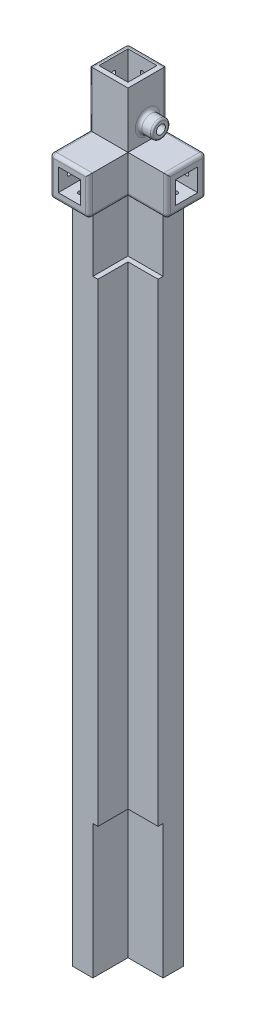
ISO-10303-21;
HEADER;
FILE_DESCRIPTION(('STEP AP214'),'2;1');
FILE_NAME('part.step','',(''),(''),'','','');
FILE_SCHEMA(('AUTOMOTIVE_DESIGN { 1 0 10303 214 1 1 1 1 }'));
ENDSEC;
DATA;
#1=APPLICATION_CONTEXT('core data for automotive mechanical design processes');
#2=APPLICATION_PROTOCOL_DEFINITION('international standard','automotive_design',2000,#1);
#3=PRODUCT_CONTEXT('',#1,'mechanical');
#4=PRODUCT('Part','Part','',(#3));
#5=PRODUCT_RELATED_PRODUCT_CATEGORY('part','',(#4));
#6=PRODUCT_DEFINITION_FORMATION('','',#4);
#7=PRODUCT_DEFINITION_CONTEXT('part definition',#1,'design');
#8=PRODUCT_DEFINITION('design','',#6,#7);
#9=PRODUCT_DEFINITION_SHAPE('','',#8);
#10=(LENGTH_UNIT() NAMED_UNIT(*) SI_UNIT(.MILLI.,.METRE.));
#11=(NAMED_UNIT(*) PLANE_ANGLE_UNIT() SI_UNIT($,.RADIAN.));
#12=(NAMED_UNIT(*) SI_UNIT($,.STERADIAN.) SOLID_ANGLE_UNIT());
#13=UNCERTAINTY_MEASURE_WITH_UNIT(LENGTH_MEASURE(1.E-05),#10,'distance_accuracy_value','');
#14=(GEOMETRIC_REPRESENTATION_CONTEXT(3) GLOBAL_UNCERTAINTY_ASSIGNED_CONTEXT((#13)) GLOBAL_UNIT_ASSIGNED_CONTEXT((#10,
#11,#12)) REPRESENTATION_CONTEXT('',''));
#15=CARTESIAN_POINT('',(0.,0.,0.));
#16=DIRECTION('',(0.,0.,1.));
#17=DIRECTION('',(1.,0.,0.));
#18=AXIS2_PLACEMENT_3D('',#15,#16,#17);
#19=CARTESIAN_POINT('',(0.,-630.,27.));
#20=DIRECTION('',(-1.,0.,0.));
#21=DIRECTION('',(0.,0.,1.));
#22=AXIS2_PLACEMENT_3D('',#19,#20,#21);
#23=PLANE('',#22);
#24=DIRECTION('',(0.,1.,0.));
#25=VECTOR('',#24,1.);
#26=CARTESIAN_POINT('',(0.,-630.,27.));
#27=LINE('',#26,#25);
#28=CARTESIAN_POINT('',(0.,-510.,27.));
#29=VERTEX_POINT('',#28);
#30=CARTESIAN_POINT('',(0.,-85.,27.));
#31=VERTEX_POINT('',#30);
#32=EDGE_CURVE('E236',#29,#31,#27,.T.);
#33=ORIENTED_EDGE('',*,*,#32,.F.);
#34=DIRECTION('',(0.,0.,1.));
#35=VECTOR('',#34,1.);
#36=CARTESIAN_POINT('',(0.,-510.,-124.584345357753));
#37=LINE('',#36,#35);
#38=CARTESIAN_POINT('',(0.,-510.,0.));
#39=VERTEX_POINT('',#38);
#40=EDGE_CURVE('E189',#39,#29,#37,.T.);
#41=ORIENTED_EDGE('',*,*,#40,.F.);
#42=DIRECTION('',(0.,1.,0.));
#43=VECTOR('',#42,1.);
#44=CARTESIAN_POINT('',(0.,-630.,0.));
#45=LINE('',#44,#43);
#46=CARTESIAN_POINT('',(0.,-85.,0.));
#47=VERTEX_POINT('',#46);
#48=EDGE_CURVE('E245',#39,#47,#45,.T.);
#49=ORIENTED_EDGE('',*,*,#48,.T.);
#50=DIRECTION('',(0.,0.,1.));
#51=VECTOR('',#50,1.);
#52=CARTESIAN_POINT('',(0.,-85.,-85.1190342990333));
#53=LINE('',#52,#51);
#54=EDGE_CURVE('E218',#47,#31,#53,.T.);
#55=ORIENTED_EDGE('',*,*,#54,.T.);
#56=EDGE_LOOP('',(#33,#41,#49,#55));
#57=FACE_BOUND('',#56,.T.);
#58=ADVANCED_FACE('F55',(#57),#23,.F.);
#59=CARTESIAN_POINT('',(-23.,-630.,27.));
#60=DIRECTION('',(0.,0.,-1.));
#61=DIRECTION('',(-1.,0.,0.));
#62=AXIS2_PLACEMENT_3D('',#59,#60,#61);
#63=PLANE('',#62);
#64=DIRECTION('',(0.,-1.,0.));
#65=VECTOR('',#64,1.);
#66=CARTESIAN_POINT('',(-4.5,-630.,27.));
#67=LINE('',#66,#65);
#68=CARTESIAN_POINT('',(-4.5,-510.,27.));
#69=VERTEX_POINT('',#68);
#70=CARTESIAN_POINT('',(-4.5,-630.,27.));
#71=VERTEX_POINT('',#70);
#72=EDGE_CURVE('E184',#69,#71,#67,.T.);
#73=ORIENTED_EDGE('',*,*,#72,.F.);
#74=DIRECTION('',(-1.,0.,0.));
#75=VECTOR('',#74,1.);
#76=CARTESIAN_POINT('',(0.,-510.,27.));
#77=LINE('',#76,#75);
#78=EDGE_CURVE('E182',#29,#69,#77,.T.);
#79=ORIENTED_EDGE('',*,*,#78,.F.);
#80=ORIENTED_EDGE('',*,*,#32,.T.);
#81=DIRECTION('',(-1.,0.,0.));
#82=VECTOR('',#81,1.);
#83=CARTESIAN_POINT('',(0.,-85.,27.));
#84=LINE('',#83,#82);
#85=CARTESIAN_POINT('',(-4.49999999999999,-85.,27.));
#86=VERTEX_POINT('',#85);
#87=EDGE_CURVE('E214',#31,#86,#84,.T.);
#88=ORIENTED_EDGE('',*,*,#87,.T.);
#89=DIRECTION('',(0.,-1.,0.));
#90=VECTOR('',#89,1.);
#91=CARTESIAN_POINT('',(-4.5,0.,27.));
#92=LINE('',#91,#90);
#93=CARTESIAN_POINT('',(-4.5,0.,27.));
#94=VERTEX_POINT('',#93);
#95=EDGE_CURVE('E213',#94,#86,#92,.T.);
#96=ORIENTED_EDGE('',*,*,#95,.F.);
#97=DIRECTION('',(-1.,0.,0.));
#98=VECTOR('',#97,1.);
#99=CARTESIAN_POINT('',(-23.,0.,27.));
#100=LINE('',#99,#98);
#101=CARTESIAN_POINT('',(-23.,0.,27.));
#102=VERTEX_POINT('',#101);
#103=EDGE_CURVE('E226',#94,#102,#100,.T.);
#104=ORIENTED_EDGE('',*,*,#103,.T.);
#105=DIRECTION('',(0.,1.,0.));
#106=VECTOR('',#105,1.);
#107=CARTESIAN_POINT('',(-23.,-630.,27.));
#108=LINE('',#107,#106);
#109=CARTESIAN_POINT('',(-23.,-630.,27.));
#110=VERTEX_POINT('',#109);
#111=EDGE_CURVE('E12',#110,#102,#108,.T.);
#112=ORIENTED_EDGE('',*,*,#111,.F.);
#113=DIRECTION('',(-1.,0.,0.));
#114=VECTOR('',#113,1.);
#115=CARTESIAN_POINT('',(-23.,-630.,27.));
#116=LINE('',#115,#114);
#117=EDGE_CURVE('E103',#71,#110,#116,.T.);
#118=ORIENTED_EDGE('',*,*,#117,.F.);
#119=EDGE_LOOP('',(#73,#79,#80,#88,#96,#104,#112,#118));
#120=FACE_BOUND('',#119,.T.);
#121=ADVANCED_FACE('F57',(#120),#63,.F.);
#122=CARTESIAN_POINT('',(-23.,-630.,27.));
#123=DIRECTION('',(1.,0.,0.));
#124=DIRECTION('',(0.,0.,-1.));
#125=AXIS2_PLACEMENT_3D('',#122,#123,#124);
#126=PLANE('',#125);
#127=DIRECTION('',(0.,0.,-1.));
#128=VECTOR('',#127,1.);
#129=CARTESIAN_POINT('',(-23.,0.,27.));
#130=LINE('',#129,#128);
#131=CARTESIAN_POINT('',(-23.,0.,0.));
#132=VERTEX_POINT('',#131);
#133=EDGE_CURVE('E238',#102,#132,#130,.T.);
#134=ORIENTED_EDGE('',*,*,#133,.T.);
#135=DIRECTION('',(0.,1.,0.));
#136=VECTOR('',#135,1.);
#137=CARTESIAN_POINT('',(-23.,-630.,0.));
#138=LINE('',#137,#136);
#139=CARTESIAN_POINT('',(-23.,-630.,0.));
#140=VERTEX_POINT('',#139);
#141=EDGE_CURVE('E64',#140,#132,#138,.T.);
#142=ORIENTED_EDGE('',*,*,#141,.F.);
#143=DIRECTION('',(0.,0.,-1.));
#144=VECTOR('',#143,1.);
#145=CARTESIAN_POINT('',(-23.,-630.,27.));
#146=LINE('',#145,#144);
#147=EDGE_CURVE('E228',#110,#140,#146,.T.);
#148=ORIENTED_EDGE('',*,*,#147,.F.);
#149=ORIENTED_EDGE('',*,*,#111,.T.);
#150=EDGE_LOOP('',(#134,#142,#148,#149));
#151=FACE_BOUND('',#150,.T.);
#152=ADVANCED_FACE('F277',(#151),#126,.F.);
#153=CARTESIAN_POINT('',(0.,-630.,0.));
#154=DIRECTION('',(0.,1.,0.));
#155=DIRECTION('',(0.,0.,1.));
#156=AXIS2_PLACEMENT_3D('',#153,#154,#155);
#157=CYLINDRICAL_SURFACE('',#156,23.);
#158=CARTESIAN_POINT('',(0.,0.,0.));
#159=DIRECTION('',(0.,-1.,0.));
#160=DIRECTION('',(0.,0.,-1.));
#161=AXIS2_PLACEMENT_3D('',#158,#159,#160);
#162=CIRCLE('',#161,23.);
#163=CARTESIAN_POINT('',(0.,0.,-23.));
#164=VERTEX_POINT('',#163);
#165=EDGE_CURVE('E90',#132,#164,#162,.T.);
#166=ORIENTED_EDGE('',*,*,#165,.T.);
#167=DIRECTION('',(0.,1.,0.));
#168=VECTOR('',#167,1.);
#169=CARTESIAN_POINT('',(0.,-630.,-23.));
#170=LINE('',#169,#168);
#171=CARTESIAN_POINT('',(0.,-630.,-23.));
#172=VERTEX_POINT('',#171);
#173=EDGE_CURVE('E251',#172,#164,#170,.T.);
#174=ORIENTED_EDGE('',*,*,#173,.F.);
#175=CARTESIAN_POINT('',(0.,-630.,0.));
#176=DIRECTION('',(0.,-1.,0.));
#177=DIRECTION('',(0.,0.,-1.));
#178=AXIS2_PLACEMENT_3D('',#175,#176,#177);
#179=CIRCLE('',#178,23.);
#180=EDGE_CURVE('E231',#140,#172,#179,.T.);
#181=ORIENTED_EDGE('',*,*,#180,.F.);
#182=ORIENTED_EDGE('',*,*,#141,.T.);
#183=EDGE_LOOP('',(#166,#174,#181,#182));
#184=FACE_BOUND('',#183,.T.);
#185=ADVANCED_FACE('F254',(#184),#157,.T.);
#186=CARTESIAN_POINT('',(27.,-630.,-23.));
#187=DIRECTION('',(0.,0.,1.));
#188=DIRECTION('',(1.,0.,0.));
#189=AXIS2_PLACEMENT_3D('',#186,#187,#188);
#190=PLANE('',#189);
#191=DIRECTION('',(1.,0.,0.));
#192=VECTOR('',#191,1.);
#193=CARTESIAN_POINT('',(27.,0.,-23.));
#194=LINE('',#193,#192);
#195=CARTESIAN_POINT('',(27.,0.,-23.));
#196=VERTEX_POINT('',#195);
#197=EDGE_CURVE('E96',#164,#196,#194,.T.);
#198=ORIENTED_EDGE('',*,*,#197,.T.);
#199=DIRECTION('',(0.,1.,0.));
#200=VECTOR('',#199,1.);
#201=CARTESIAN_POINT('',(27.,-630.,-23.));
#202=LINE('',#201,#200);
#203=CARTESIAN_POINT('',(27.,-630.,-23.));
#204=VERTEX_POINT('',#203);
#205=EDGE_CURVE('E249',#204,#196,#202,.T.);
#206=ORIENTED_EDGE('',*,*,#205,.F.);
#207=DIRECTION('',(1.,0.,0.));
#208=VECTOR('',#207,1.);
#209=CARTESIAN_POINT('',(27.,-630.,-23.));
#210=LINE('',#209,#208);
#211=EDGE_CURVE('E72',#172,#204,#210,.T.);
#212=ORIENTED_EDGE('',*,*,#211,.F.);
#213=ORIENTED_EDGE('',*,*,#173,.T.);
#214=EDGE_LOOP('',(#198,#206,#212,#213));
#215=FACE_BOUND('',#214,.T.);
#216=ADVANCED_FACE('F267',(#215),#190,.F.);
#217=CARTESIAN_POINT('',(27.,-630.,0.));
#218=DIRECTION('',(-1.,0.,0.));
#219=DIRECTION('',(0.,0.,1.));
#220=AXIS2_PLACEMENT_3D('',#217,#218,#219);
#221=PLANE('',#220);
#222=DIRECTION('',(0.,0.,1.));
#223=VECTOR('',#222,1.);
#224=CARTESIAN_POINT('',(27.,-510.,0.));
#225=LINE('',#224,#223);
#226=CARTESIAN_POINT('',(27.,-510.,-4.5));
#227=VERTEX_POINT('',#226);
#228=CARTESIAN_POINT('',(27.,-510.,0.));
#229=VERTEX_POINT('',#228);
#230=EDGE_CURVE('E191',#227,#229,#225,.T.);
#231=ORIENTED_EDGE('',*,*,#230,.F.);
#232=DIRECTION('',(0.,1.,0.));
#233=VECTOR('',#232,1.);
#234=CARTESIAN_POINT('',(27.,-630.,-4.5));
#235=LINE('',#234,#233);
#236=CARTESIAN_POINT('',(27.,-630.,-4.5));
#237=VERTEX_POINT('',#236);
#238=EDGE_CURVE('E166',#237,#227,#235,.T.);
#239=ORIENTED_EDGE('',*,*,#238,.F.);
#240=DIRECTION('',(0.,0.,1.));
#241=VECTOR('',#240,1.);
#242=CARTESIAN_POINT('',(27.,-630.,0.));
#243=LINE('',#242,#241);
#244=EDGE_CURVE('E234',#204,#237,#243,.T.);
#245=ORIENTED_EDGE('',*,*,#244,.F.);
#246=ORIENTED_EDGE('',*,*,#205,.T.);
#247=DIRECTION('',(0.,0.,1.));
#248=VECTOR('',#247,1.);
#249=CARTESIAN_POINT('',(27.,0.,0.));
#250=LINE('',#249,#248);
#251=CARTESIAN_POINT('',(27.,0.,-4.5));
#252=VERTEX_POINT('',#251);
#253=EDGE_CURVE('E229',#196,#252,#250,.T.);
#254=ORIENTED_EDGE('',*,*,#253,.T.);
#255=DIRECTION('',(0.,1.,0.));
#256=VECTOR('',#255,1.);
#257=CARTESIAN_POINT('',(27.,0.,-4.5));
#258=LINE('',#257,#256);
#259=CARTESIAN_POINT('',(27.,-85.,-4.50000000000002));
#260=VERTEX_POINT('',#259);
#261=EDGE_CURVE('E198',#260,#252,#258,.T.);
#262=ORIENTED_EDGE('',*,*,#261,.F.);
#263=DIRECTION('',(0.,0.,-1.));
#264=VECTOR('',#263,1.);
#265=CARTESIAN_POINT('',(27.,-85.,0.));
#266=LINE('',#265,#264);
#267=CARTESIAN_POINT('',(27.,-85.,0.));
#268=VERTEX_POINT('',#267);
#269=EDGE_CURVE('E195',#268,#260,#266,.T.);
#270=ORIENTED_EDGE('',*,*,#269,.F.);
#271=DIRECTION('',(0.,1.,0.));
#272=VECTOR('',#271,1.);
#273=CARTESIAN_POINT('',(27.,-630.,0.));
#274=LINE('',#273,#272);
#275=EDGE_CURVE('E247',#229,#268,#274,.T.);
#276=ORIENTED_EDGE('',*,*,#275,.F.);
#277=EDGE_LOOP('',(#231,#239,#245,#246,#254,#262,#270,#276));
#278=FACE_BOUND('',#277,.T.);
#279=ADVANCED_FACE('F264',(#278),#221,.F.);
#280=CARTESIAN_POINT('',(0.,-630.,0.));
#281=DIRECTION('',(0.,0.,-1.));
#282=DIRECTION('',(-1.,0.,0.));
#283=AXIS2_PLACEMENT_3D('',#280,#281,#282);
#284=PLANE('',#283);
#285=ORIENTED_EDGE('',*,*,#48,.F.);
#286=DIRECTION('',(1.,0.,0.));
#287=VECTOR('',#286,1.);
#288=CARTESIAN_POINT('',(-120.084345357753,-510.,0.));
#289=LINE('',#288,#287);
#290=EDGE_CURVE('E170',#39,#229,#289,.T.);
#291=ORIENTED_EDGE('',*,*,#290,.T.);
#292=ORIENTED_EDGE('',*,*,#275,.T.);
#293=DIRECTION('',(1.,0.,0.));
#294=VECTOR('',#293,1.);
#295=CARTESIAN_POINT('',(-89.6190342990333,-85.,0.));
#296=LINE('',#295,#294);
#297=EDGE_CURVE('E209',#47,#268,#296,.T.);
#298=ORIENTED_EDGE('',*,*,#297,.F.);
#299=EDGE_LOOP('',(#285,#291,#292,#298));
#300=FACE_BOUND('',#299,.T.);
#301=ADVANCED_FACE('F275',(#300),#284,.F.);
#302=CARTESIAN_POINT('',(0.,-630.,0.));
#303=DIRECTION('',(0.,-1.,0.));
#304=DIRECTION('',(0.,0.,-1.));
#305=AXIS2_PLACEMENT_3D('',#302,#303,#304);
#306=PLANE('',#305);
#307=DIRECTION('',(1.,0.,0.));
#308=VECTOR('',#307,1.);
#309=CARTESIAN_POINT('',(-120.084345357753,-630.,-4.50000000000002));
#310=LINE('',#309,#308);
#311=CARTESIAN_POINT('',(-4.5,-630.,-4.50000000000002));
#312=VERTEX_POINT('',#311);
#313=EDGE_CURVE('E171',#312,#237,#310,.T.);
#314=ORIENTED_EDGE('',*,*,#313,.F.);
#315=DIRECTION('',(0.,0.,1.));
#316=VECTOR('',#315,1.);
#317=CARTESIAN_POINT('',(-4.5,-630.,-124.584345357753));
#318=LINE('',#317,#316);
#319=EDGE_CURVE('E178',#312,#71,#318,.T.);
#320=ORIENTED_EDGE('',*,*,#319,.T.);
#321=ORIENTED_EDGE('',*,*,#117,.T.);
#322=ORIENTED_EDGE('',*,*,#147,.T.);
#323=ORIENTED_EDGE('',*,*,#180,.T.);
#324=ORIENTED_EDGE('',*,*,#211,.T.);
#325=ORIENTED_EDGE('',*,*,#244,.T.);
#326=EDGE_LOOP('',(#314,#320,#321,#322,#323,#324,#325));
#327=FACE_BOUND('',#326,.T.);
#328=ADVANCED_FACE('F291',(#327),#306,.T.);
#329=CARTESIAN_POINT('',(0.,0.,0.));
#330=DIRECTION('',(0.,-1.,0.));
#331=DIRECTION('',(0.,0.,-1.));
#332=AXIS2_PLACEMENT_3D('',#329,#330,#331);
#333=PLANE('',#332);
#334=DIRECTION('',(0.,0.,1.));
#335=VECTOR('',#334,1.);
#336=CARTESIAN_POINT('',(-4.5,0.,-85.1190342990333));
#337=LINE('',#336,#335);
#338=CARTESIAN_POINT('',(-4.5,0.,-4.5));
#339=VERTEX_POINT('',#338);
#340=EDGE_CURVE('E217',#339,#94,#337,.T.);
#341=ORIENTED_EDGE('',*,*,#340,.F.);
#342=DIRECTION('',(1.,0.,0.));
#343=VECTOR('',#342,1.);
#344=CARTESIAN_POINT('',(-89.6190342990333,0.,-4.50000000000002));
#345=LINE('',#344,#343);
#346=EDGE_CURVE('E206',#339,#252,#345,.T.);
#347=ORIENTED_EDGE('',*,*,#346,.T.);
#348=ORIENTED_EDGE('',*,*,#253,.F.);
#349=ORIENTED_EDGE('',*,*,#197,.F.);
#350=ORIENTED_EDGE('',*,*,#165,.F.);
#351=ORIENTED_EDGE('',*,*,#133,.F.);
#352=ORIENTED_EDGE('',*,*,#103,.F.);
#353=EDGE_LOOP('',(#341,#347,#348,#349,#350,#351,#352));
#354=FACE_BOUND('',#353,.T.);
#355=ADVANCED_FACE('F258',(#354),#333,.F.);
#356=CARTESIAN_POINT('',(-4.5,0.,-85.1190342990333));
#357=DIRECTION('',(-1.,0.,0.));
#358=DIRECTION('',(0.,-1.,0.));
#359=AXIS2_PLACEMENT_3D('',#356,#357,#358);
#360=PLANE('',#359);
#361=ORIENTED_EDGE('',*,*,#340,.T.);
#362=ORIENTED_EDGE('',*,*,#95,.T.);
#363=DIRECTION('',(0.,0.,1.));
#364=VECTOR('',#363,1.);
#365=CARTESIAN_POINT('',(-4.49999999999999,-85.,-85.1190342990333));
#366=LINE('',#365,#364);
#367=CARTESIAN_POINT('',(-4.49999999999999,-85.,-4.50000000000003));
#368=VERTEX_POINT('',#367);
#369=EDGE_CURVE('E221',#368,#86,#366,.T.);
#370=ORIENTED_EDGE('',*,*,#369,.F.);
#371=DIRECTION('',(0.,1.,0.));
#372=VECTOR('',#371,1.);
#373=CARTESIAN_POINT('',(-4.5,0.,-4.5));
#374=LINE('',#373,#372);
#375=EDGE_CURVE('E203',#368,#339,#374,.T.);
#376=ORIENTED_EDGE('',*,*,#375,.T.);
#377=EDGE_LOOP('',(#361,#362,#370,#376));
#378=FACE_BOUND('',#377,.T.);
#379=ADVANCED_FACE('F352',(#378),#360,.F.);
#380=CARTESIAN_POINT('',(0.,-85.,-85.1190342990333));
#381=DIRECTION('',(0.,1.,0.));
#382=DIRECTION('',(0.,0.,1.));
#383=AXIS2_PLACEMENT_3D('',#380,#381,#382);
#384=PLANE('',#383);
#385=ORIENTED_EDGE('',*,*,#54,.F.);
#386=ORIENTED_EDGE('',*,*,#297,.T.);
#387=ORIENTED_EDGE('',*,*,#269,.T.);
#388=DIRECTION('',(1.,0.,0.));
#389=VECTOR('',#388,1.);
#390=CARTESIAN_POINT('',(-89.6190342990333,-85.,-4.50000000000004));
#391=LINE('',#390,#389);
#392=EDGE_CURVE('E200',#368,#260,#391,.T.);
#393=ORIENTED_EDGE('',*,*,#392,.F.);
#394=ORIENTED_EDGE('',*,*,#369,.T.);
#395=ORIENTED_EDGE('',*,*,#87,.F.);
#396=EDGE_LOOP('',(#385,#386,#387,#393,#394,#395));
#397=FACE_BOUND('',#396,.T.);
#398=ADVANCED_FACE('F302',(#397),#384,.T.);
#399=CARTESIAN_POINT('',(-89.6190342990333,0.,-4.50000000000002));
#400=DIRECTION('',(0.,0.,-1.));
#401=DIRECTION('',(0.,1.,0.));
#402=AXIS2_PLACEMENT_3D('',#399,#400,#401);
#403=PLANE('',#402);
#404=ORIENTED_EDGE('',*,*,#392,.T.);
#405=ORIENTED_EDGE('',*,*,#261,.T.);
#406=ORIENTED_EDGE('',*,*,#346,.F.);
#407=ORIENTED_EDGE('',*,*,#375,.F.);
#408=EDGE_LOOP('',(#404,#405,#406,#407));
#409=FACE_BOUND('',#408,.T.);
#410=ADVANCED_FACE('F376',(#409),#403,.F.);
#411=CARTESIAN_POINT('',(-120.084345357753,-630.,-4.50000000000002));
#412=DIRECTION('',(0.,0.,-1.));
#413=DIRECTION('',(-1.,0.,0.));
#414=AXIS2_PLACEMENT_3D('',#411,#412,#413);
#415=PLANE('',#414);
#416=ORIENTED_EDGE('',*,*,#313,.T.);
#417=ORIENTED_EDGE('',*,*,#238,.T.);
#418=DIRECTION('',(1.,0.,0.));
#419=VECTOR('',#418,1.);
#420=CARTESIAN_POINT('',(-120.084345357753,-510.,-4.50000000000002));
#421=LINE('',#420,#419);
#422=CARTESIAN_POINT('',(-4.5,-510.,-4.5));
#423=VERTEX_POINT('',#422);
#424=EDGE_CURVE('E161',#423,#227,#421,.T.);
#425=ORIENTED_EDGE('',*,*,#424,.F.);
#426=DIRECTION('',(0.,-1.,0.));
#427=VECTOR('',#426,1.);
#428=CARTESIAN_POINT('',(-4.5,-630.,-4.50000000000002));
#429=LINE('',#428,#427);
#430=EDGE_CURVE('E164',#423,#312,#429,.T.);
#431=ORIENTED_EDGE('',*,*,#430,.T.);
#432=EDGE_LOOP('',(#416,#417,#425,#431));
#433=FACE_BOUND('',#432,.T.);
#434=ADVANCED_FACE('F163',(#433),#415,.F.);
#435=CARTESIAN_POINT('',(-120.084345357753,-510.,0.));
#436=DIRECTION('',(0.,1.,0.));
#437=DIRECTION('',(0.,0.,1.));
#438=AXIS2_PLACEMENT_3D('',#435,#436,#437);
#439=PLANE('',#438);
#440=ORIENTED_EDGE('',*,*,#424,.T.);
#441=ORIENTED_EDGE('',*,*,#230,.T.);
#442=ORIENTED_EDGE('',*,*,#290,.F.);
#443=ORIENTED_EDGE('',*,*,#40,.T.);
#444=ORIENTED_EDGE('',*,*,#78,.T.);
#445=DIRECTION('',(0.,0.,1.));
#446=VECTOR('',#445,1.);
#447=CARTESIAN_POINT('',(-4.5,-510.,-124.584345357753));
#448=LINE('',#447,#446);
#449=EDGE_CURVE('E176',#423,#69,#448,.T.);
#450=ORIENTED_EDGE('',*,*,#449,.F.);
#451=EDGE_LOOP('',(#440,#441,#442,#443,#444,#450));
#452=FACE_BOUND('',#451,.T.);
#453=ADVANCED_FACE('F180',(#452),#439,.F.);
#454=CARTESIAN_POINT('',(-4.5,-630.,-124.584345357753));
#455=DIRECTION('',(-1.,0.,0.));
#456=DIRECTION('',(0.,0.,1.));
#457=AXIS2_PLACEMENT_3D('',#454,#455,#456);
#458=PLANE('',#457);
#459=ORIENTED_EDGE('',*,*,#449,.T.);
#460=ORIENTED_EDGE('',*,*,#72,.T.);
#461=ORIENTED_EDGE('',*,*,#319,.F.);
#462=ORIENTED_EDGE('',*,*,#430,.F.);
#463=EDGE_LOOP('',(#459,#460,#461,#462));
#464=FACE_BOUND('',#463,.T.);
#465=ADVANCED_FACE('F175',(#464),#458,.F.);
#466=CLOSED_SHELL('',(#58,#121,#152,#185,#216,#279,#301,#328,#355,#379,#398,#410,#434,#453,#465));
#467=MANIFOLD_SOLID_BREP('B2',#466);
#468=CARTESIAN_POINT('',(0.,0.,35.));
#469=DIRECTION('',(0.,0.,1.));
#470=DIRECTION('',(1.,0.,0.));
#471=AXIS2_PLACEMENT_3D('',#468,#469,#470);
#472=PLANE('',#471);
#473=DIRECTION('',(-1.,0.,0.));
#474=VECTOR('',#473,1.);
#475=CARTESIAN_POINT('',(35.,85.,35.));
#476=LINE('',#475,#474);
#477=CARTESIAN_POINT('',(35.,85.,35.));
#478=VERTEX_POINT('',#477);
#479=CARTESIAN_POINT('',(3.,85.,35.));
#480=VERTEX_POINT('',#479);
#481=EDGE_CURVE('E767',#478,#480,#476,.T.);
#482=ORIENTED_EDGE('',*,*,#481,.T.);
#483=DIRECTION('',(0.,-1.,0.));
#484=VECTOR('',#483,1.);
#485=CARTESIAN_POINT('',(3.,35.,35.));
#486=LINE('',#485,#484);
#487=CARTESIAN_POINT('',(3.,35.,35.));
#488=VERTEX_POINT('',#487);
#489=EDGE_CURVE('E879',#480,#488,#486,.T.);
#490=ORIENTED_EDGE('',*,*,#489,.T.);
#491=DIRECTION('',(-1.,0.,0.));
#492=VECTOR('',#491,1.);
#493=CARTESIAN_POINT('',(0.,35.,35.));
#494=LINE('',#493,#492);
#495=CARTESIAN_POINT('',(35.,35.,35.));
#496=VERTEX_POINT('',#495);
#497=EDGE_CURVE('E761',#496,#488,#494,.T.);
#498=ORIENTED_EDGE('',*,*,#497,.F.);
#499=DIRECTION('',(0.,1.,0.));
#500=VECTOR('',#499,1.);
#501=CARTESIAN_POINT('',(35.,35.,35.));
#502=LINE('',#501,#500);
#503=EDGE_CURVE('E772',#496,#478,#502,.T.);
#504=ORIENTED_EDGE('',*,*,#503,.T.);
#505=EDGE_LOOP('',(#482,#490,#498,#504));
#506=FACE_BOUND('',#505,.T.);
#507=ADVANCED_FACE('F430',(#506),#472,.T.);
#508=CARTESIAN_POINT('',(35.,85.,35.));
#509=DIRECTION('',(0.,-1.,0.));
#510=DIRECTION('',(0.,0.,-1.));
#511=AXIS2_PLACEMENT_3D('',#508,#509,#510);
#512=PLANE('',#511);
#513=DIRECTION('',(-1.,0.,0.));
#514=VECTOR('',#513,1.);
#515=CARTESIAN_POINT('',(4.50000000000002,85.,4.5));
#516=LINE('',#515,#514);
#517=CARTESIAN_POINT('',(30.5,85.,4.5));
#518=VERTEX_POINT('',#517);
#519=CARTESIAN_POINT('',(4.50000000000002,85.,4.5));
#520=VERTEX_POINT('',#519);
#521=EDGE_CURVE('E678',#518,#520,#516,.T.);
#522=ORIENTED_EDGE('',*,*,#521,.F.);
#523=DIRECTION('',(0.,0.,-1.));
#524=VECTOR('',#523,1.);
#525=CARTESIAN_POINT('',(30.5,85.,4.5));
#526=LINE('',#525,#524);
#527=CARTESIAN_POINT('',(30.5,85.,30.5));
#528=VERTEX_POINT('',#527);
#529=EDGE_CURVE('E649',#528,#518,#526,.T.);
#530=ORIENTED_EDGE('',*,*,#529,.F.);
#531=DIRECTION('',(1.,0.,0.));
#532=VECTOR('',#531,1.);
#533=CARTESIAN_POINT('',(4.50000000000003,85.,30.5));
#534=LINE('',#533,#532);
#535=CARTESIAN_POINT('',(4.50000000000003,85.,30.5));
#536=VERTEX_POINT('',#535);
#537=EDGE_CURVE('E666',#536,#528,#534,.T.);
#538=ORIENTED_EDGE('',*,*,#537,.F.);
#539=DIRECTION('',(0.,0.,1.));
#540=VECTOR('',#539,1.);
#541=CARTESIAN_POINT('',(4.50000000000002,85.,4.5));
#542=LINE('',#541,#540);
#543=EDGE_CURVE('E669',#520,#536,#542,.T.);
#544=ORIENTED_EDGE('',*,*,#543,.F.);
#545=EDGE_LOOP('',(#522,#530,#538,#544));
#546=FACE_BOUND('',#545,.T.);
#547=DIRECTION('',(0.,0.,-1.));
#548=VECTOR('',#547,1.);
#549=CARTESIAN_POINT('',(35.,85.,35.));
#550=LINE('',#549,#548);
#551=CARTESIAN_POINT('',(35.,85.,3.));
#552=VERTEX_POINT('',#551);
#553=EDGE_CURVE('E774',#478,#552,#550,.T.);
#554=ORIENTED_EDGE('',*,*,#553,.T.);
#555=DIRECTION('',(-1.,0.,0.));
#556=VECTOR('',#555,1.);
#557=CARTESIAN_POINT('',(35.,85.,3.));
#558=LINE('',#557,#556);
#559=CARTESIAN_POINT('',(3.,85.,3.));
#560=VERTEX_POINT('',#559);
#561=EDGE_CURVE('E803',#552,#560,#558,.T.);
#562=ORIENTED_EDGE('',*,*,#561,.T.);
#563=DIRECTION('',(0.,0.,-1.));
#564=VECTOR('',#563,1.);
#565=CARTESIAN_POINT('',(3.,85.,35.));
#566=LINE('',#565,#564);
#567=EDGE_CURVE('E780',#560,#480,#566,.F.);
#568=ORIENTED_EDGE('',*,*,#567,.T.);
#569=ORIENTED_EDGE('',*,*,#481,.F.);
#570=EDGE_LOOP('',(#554,#562,#568,#569));
#571=FACE_BOUND('',#570,.T.);
#572=ADVANCED_FACE('F991',(#546,#571),#512,.F.);
#573=CARTESIAN_POINT('',(0.,85.,35.));
#574=DIRECTION('',(1.,0.,0.));
#575=DIRECTION('',(0.,1.,0.));
#576=AXIS2_PLACEMENT_3D('',#573,#574,#575);
#577=PLANE('',#576);
#578=DIRECTION('',(0.,-1.,0.));
#579=VECTOR('',#578,1.);
#580=CARTESIAN_POINT('',(0.,85.,32.));
#581=LINE('',#580,#579);
#582=CARTESIAN_POINT('',(0.,32.,32.));
#583=VERTEX_POINT('',#582);
#584=CARTESIAN_POINT('',(0.,82.,32.));
#585=VERTEX_POINT('',#584);
#586=EDGE_CURVE('E453',#583,#585,#581,.F.);
#587=ORIENTED_EDGE('',*,*,#586,.T.);
#588=DIRECTION('',(0.,0.,-1.));
#589=VECTOR('',#588,1.);
#590=CARTESIAN_POINT('',(0.,82.,35.));
#591=LINE('',#590,#589);
#592=CARTESIAN_POINT('',(0.,82.,3.));
#593=VERTEX_POINT('',#592);
#594=EDGE_CURVE('E877',#585,#593,#591,.T.);
#595=ORIENTED_EDGE('',*,*,#594,.T.);
#596=DIRECTION('',(0.,-1.,0.));
#597=VECTOR('',#596,1.);
#598=CARTESIAN_POINT('',(0.,85.,3.));
#599=LINE('',#598,#597);
#600=CARTESIAN_POINT('',(0.,3.,3.));
#601=VERTEX_POINT('',#600);
#602=EDGE_CURVE('E875',#593,#601,#599,.T.);
#603=ORIENTED_EDGE('',*,*,#602,.T.);
#604=DIRECTION('',(0.,0.,-1.));
#605=VECTOR('',#604,1.);
#606=CARTESIAN_POINT('',(0.,3.,35.));
#607=LINE('',#606,#605);
#608=CARTESIAN_POINT('',(0.,3.,67.));
#609=VERTEX_POINT('',#608);
#610=EDGE_CURVE('E868',#601,#609,#607,.F.);
#611=ORIENTED_EDGE('',*,*,#610,.T.);
#612=DIRECTION('',(0.,-1.,0.));
#613=VECTOR('',#612,1.);
#614=CARTESIAN_POINT('',(0.,85.,67.));
#615=LINE('',#614,#613);
#616=CARTESIAN_POINT('',(0.,32.,67.));
#617=VERTEX_POINT('',#616);
#618=EDGE_CURVE('E870',#609,#617,#615,.F.);
#619=ORIENTED_EDGE('',*,*,#618,.T.);
#620=DIRECTION('',(0.,0.,-1.));
#621=VECTOR('',#620,1.);
#622=CARTESIAN_POINT('',(0.,32.,35.));
#623=LINE('',#622,#621);
#624=EDGE_CURVE('E872',#617,#583,#623,.T.);
#625=ORIENTED_EDGE('',*,*,#624,.T.);
#626=EDGE_LOOP('',(#587,#595,#603,#611,#619,#625));
#627=FACE_BOUND('',#626,.T.);
#628=CARTESIAN_POINT('',(0.,72.5,17.5));
#629=DIRECTION('',(-1.,0.,0.));
#630=DIRECTION('',(0.,-1.,0.));
#631=AXIS2_PLACEMENT_3D('',#628,#629,#630);
#632=CIRCLE('',#631,2.);
#633=CARTESIAN_POINT('',(0.,70.5,17.5));
#634=VERTEX_POINT('',#633);
#635=EDGE_CURVE('E784',#634,#634,#632,.T.);
#636=ORIENTED_EDGE('',*,*,#635,.F.);
#637=EDGE_LOOP('',(#636));
#638=FACE_BOUND('',#637,.T.);
#639=CARTESIAN_POINT('',(0.,17.5,60.));
#640=DIRECTION('',(-1.,0.,0.));
#641=DIRECTION('',(0.,-1.,0.));
#642=AXIS2_PLACEMENT_3D('',#639,#640,#641);
#643=CIRCLE('',#642,2.);
#644=CARTESIAN_POINT('',(0.,15.5,60.));
#645=VERTEX_POINT('',#644);
#646=EDGE_CURVE('E672',#645,#645,#643,.T.);
#647=ORIENTED_EDGE('',*,*,#646,.F.);
#648=EDGE_LOOP('',(#647));
#649=FACE_BOUND('',#648,.T.);
#650=ADVANCED_FACE('F999',(#627,#638,#649),#577,.F.);
#651=CARTESIAN_POINT('',(0.,0.,35.));
#652=DIRECTION('',(0.,1.,0.));
#653=DIRECTION('',(0.,0.,1.));
#654=AXIS2_PLACEMENT_3D('',#651,#652,#653);
#655=PLANE('',#654);
#656=DIRECTION('',(0.,0.,-1.));
#657=VECTOR('',#656,1.);
#658=CARTESIAN_POINT('',(32.,0.,35.));
#659=LINE('',#658,#657);
#660=CARTESIAN_POINT('',(32.,0.,32.));
#661=VERTEX_POINT('',#660);
#662=CARTESIAN_POINT('',(32.,0.,67.));
#663=VERTEX_POINT('',#662);
#664=EDGE_CURVE('E836',#661,#663,#659,.F.);
#665=ORIENTED_EDGE('',*,*,#664,.T.);
#666=DIRECTION('',(1.,0.,0.));
#667=VECTOR('',#666,1.);
#668=CARTESIAN_POINT('',(0.,0.,67.));
#669=LINE('',#668,#667);
#670=CARTESIAN_POINT('',(3.,0.,67.));
#671=VERTEX_POINT('',#670);
#672=EDGE_CURVE('E838',#663,#671,#669,.F.);
#673=ORIENTED_EDGE('',*,*,#672,.T.);
#674=DIRECTION('',(0.,0.,-1.));
#675=VECTOR('',#674,1.);
#676=CARTESIAN_POINT('',(3.,0.,35.));
#677=LINE('',#676,#675);
#678=CARTESIAN_POINT('',(3.,0.,3.));
#679=VERTEX_POINT('',#678);
#680=EDGE_CURVE('E828',#671,#679,#677,.T.);
#681=ORIENTED_EDGE('',*,*,#680,.T.);
#682=DIRECTION('',(1.,0.,0.));
#683=VECTOR('',#682,1.);
#684=CARTESIAN_POINT('',(0.,0.,3.));
#685=LINE('',#684,#683);
#686=CARTESIAN_POINT('',(67.,0.,3.));
#687=VERTEX_POINT('',#686);
#688=EDGE_CURVE('E830',#679,#687,#685,.T.);
#689=ORIENTED_EDGE('',*,*,#688,.T.);
#690=DIRECTION('',(0.,0.,-1.));
#691=VECTOR('',#690,1.);
#692=CARTESIAN_POINT('',(67.,0.,35.));
#693=LINE('',#692,#691);
#694=CARTESIAN_POINT('',(67.,0.,32.));
#695=VERTEX_POINT('',#694);
#696=EDGE_CURVE('E832',#687,#695,#693,.F.);
#697=ORIENTED_EDGE('',*,*,#696,.T.);
#698=DIRECTION('',(1.,0.,0.));
#699=VECTOR('',#698,1.);
#700=CARTESIAN_POINT('',(35.,0.,32.));
#701=LINE('',#700,#699);
#702=EDGE_CURVE('E834',#695,#661,#701,.F.);
#703=ORIENTED_EDGE('',*,*,#702,.T.);
#704=EDGE_LOOP('',(#665,#673,#681,#689,#697,#703));
#705=FACE_BOUND('',#704,.T.);
#706=CARTESIAN_POINT('',(17.5,0.,60.));
#707=DIRECTION('',(0.,-1.,0.));
#708=DIRECTION('',(0.,0.,-1.));
#709=AXIS2_PLACEMENT_3D('',#706,#707,#708);
#710=CIRCLE('',#709,2.);
#711=CARTESIAN_POINT('',(17.5,0.,58.));
#712=VERTEX_POINT('',#711);
#713=EDGE_CURVE('E798',#712,#712,#710,.T.);
#714=ORIENTED_EDGE('',*,*,#713,.F.);
#715=EDGE_LOOP('',(#714));
#716=FACE_BOUND('',#715,.T.);
#717=CARTESIAN_POINT('',(60.,0.,17.5));
#718=DIRECTION('',(0.,-1.,0.));
#719=DIRECTION('',(0.,0.,-1.));
#720=AXIS2_PLACEMENT_3D('',#717,#718,#719);
#721=CIRCLE('',#720,2.);
#722=CARTESIAN_POINT('',(60.,0.,15.5));
#723=VERTEX_POINT('',#722);
#724=EDGE_CURVE('E969',#723,#723,#721,.T.);
#725=ORIENTED_EDGE('',*,*,#724,.F.);
#726=EDGE_LOOP('',(#725));
#727=FACE_BOUND('',#726,.T.);
#728=ADVANCED_FACE('F1094',(#705,#716,#727),#655,.F.);
#729=CARTESIAN_POINT('',(70.,0.,35.));
#730=DIRECTION('',(-1.,0.,0.));
#731=DIRECTION('',(0.,0.,1.));
#732=AXIS2_PLACEMENT_3D('',#729,#730,#731);
#733=PLANE('',#732);
#734=DIRECTION('',(0.,0.,-1.));
#735=VECTOR('',#734,1.);
#736=CARTESIAN_POINT('',(70.,32.,35.));
#737=LINE('',#736,#735);
#738=CARTESIAN_POINT('',(70.,32.,3.));
#739=VERTEX_POINT('',#738);
#740=CARTESIAN_POINT('',(70.,32.,32.));
#741=VERTEX_POINT('',#740);
#742=EDGE_CURVE('E857',#739,#741,#737,.F.);
#743=ORIENTED_EDGE('',*,*,#742,.T.);
#744=DIRECTION('',(0.,1.,0.));
#745=VECTOR('',#744,1.);
#746=CARTESIAN_POINT('',(70.,0.,32.));
#747=LINE('',#746,#745);
#748=CARTESIAN_POINT('',(70.,3.,32.));
#749=VERTEX_POINT('',#748);
#750=EDGE_CURVE('E859',#741,#749,#747,.F.);
#751=ORIENTED_EDGE('',*,*,#750,.T.);
#752=DIRECTION('',(0.,0.,-1.));
#753=VECTOR('',#752,1.);
#754=CARTESIAN_POINT('',(70.,3.,35.));
#755=LINE('',#754,#753);
#756=CARTESIAN_POINT('',(70.,3.,3.));
#757=VERTEX_POINT('',#756);
#758=EDGE_CURVE('E855',#749,#757,#755,.T.);
#759=ORIENTED_EDGE('',*,*,#758,.T.);
#760=DIRECTION('',(0.,1.,0.));
#761=VECTOR('',#760,1.);
#762=CARTESIAN_POINT('',(70.,0.,3.));
#763=LINE('',#762,#761);
#764=EDGE_CURVE('E853',#757,#739,#763,.T.);
#765=ORIENTED_EDGE('',*,*,#764,.T.);
#766=EDGE_LOOP('',(#743,#751,#759,#765));
#767=FACE_BOUND('',#766,.T.);
#768=DIRECTION('',(0.,0.,1.));
#769=VECTOR('',#768,1.);
#770=CARTESIAN_POINT('',(70.,27.5,27.5));
#771=LINE('',#770,#769);
#772=CARTESIAN_POINT('',(70.,27.5,7.50000000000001));
#773=VERTEX_POINT('',#772);
#774=CARTESIAN_POINT('',(70.,27.5,27.5));
#775=VERTEX_POINT('',#774);
#776=EDGE_CURVE('E710',#773,#775,#771,.T.);
#777=ORIENTED_EDGE('',*,*,#776,.F.);
#778=DIRECTION('',(0.,1.,0.));
#779=VECTOR('',#778,1.);
#780=CARTESIAN_POINT('',(70.,27.5,7.50000000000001));
#781=LINE('',#780,#779);
#782=CARTESIAN_POINT('',(70.,7.5,7.5));
#783=VERTEX_POINT('',#782);
#784=EDGE_CURVE('E692',#783,#773,#781,.T.);
#785=ORIENTED_EDGE('',*,*,#784,.F.);
#786=DIRECTION('',(0.,0.,-1.));
#787=VECTOR('',#786,1.);
#788=CARTESIAN_POINT('',(70.,7.5,27.5));
#789=LINE('',#788,#787);
#790=CARTESIAN_POINT('',(70.,7.5,27.5));
#791=VERTEX_POINT('',#790);
#792=EDGE_CURVE('E699',#791,#783,#789,.T.);
#793=ORIENTED_EDGE('',*,*,#792,.F.);
#794=DIRECTION('',(0.,-1.,0.));
#795=VECTOR('',#794,1.);
#796=CARTESIAN_POINT('',(70.,27.5,27.5));
#797=LINE('',#796,#795);
#798=EDGE_CURVE('E713',#775,#791,#797,.T.);
#799=ORIENTED_EDGE('',*,*,#798,.F.);
#800=EDGE_LOOP('',(#777,#785,#793,#799));
#801=FACE_BOUND('',#800,.T.);
#802=ADVANCED_FACE('F1108',(#767,#801),#733,.F.);
#803=CARTESIAN_POINT('',(70.,35.,35.));
#804=DIRECTION('',(0.,-1.,0.));
#805=DIRECTION('',(0.,0.,-1.));
#806=AXIS2_PLACEMENT_3D('',#803,#804,#805);
#807=PLANE('',#806);
#808=DIRECTION('',(-1.,0.,0.));
#809=VECTOR('',#808,1.);
#810=CARTESIAN_POINT('',(70.,35.,35.));
#811=LINE('',#810,#809);
#812=CARTESIAN_POINT('',(67.,35.,35.));
#813=VERTEX_POINT('',#812);
#814=EDGE_CURVE('E770',#813,#496,#811,.T.);
#815=ORIENTED_EDGE('',*,*,#814,.F.);
#816=DIRECTION('',(0.,0.,-1.));
#817=VECTOR('',#816,1.);
#818=CARTESIAN_POINT('',(67.,35.,35.));
#819=LINE('',#818,#817);
#820=CARTESIAN_POINT('',(67.,35.,3.));
#821=VERTEX_POINT('',#820);
#822=EDGE_CURVE('E864',#813,#821,#819,.T.);
#823=ORIENTED_EDGE('',*,*,#822,.T.);
#824=DIRECTION('',(-1.,0.,0.));
#825=VECTOR('',#824,1.);
#826=CARTESIAN_POINT('',(70.,35.,3.));
#827=LINE('',#826,#825);
#828=CARTESIAN_POINT('',(35.,35.,3.));
#829=VERTEX_POINT('',#828);
#830=EDGE_CURVE('E862',#821,#829,#827,.T.);
#831=ORIENTED_EDGE('',*,*,#830,.T.);
#832=DIRECTION('',(0.,0.,-1.));
#833=VECTOR('',#832,1.);
#834=CARTESIAN_POINT('',(35.,35.,35.));
#835=LINE('',#834,#833);
#836=EDGE_CURVE('E777',#496,#829,#835,.T.);
#837=ORIENTED_EDGE('',*,*,#836,.F.);
#838=EDGE_LOOP('',(#815,#823,#831,#837));
#839=FACE_BOUND('',#838,.T.);
#840=ADVANCED_FACE('F1015',(#839),#807,.F.);
#841=CARTESIAN_POINT('',(35.,35.,35.));
#842=DIRECTION('',(-1.,0.,0.));
#843=DIRECTION('',(0.,0.,1.));
#844=AXIS2_PLACEMENT_3D('',#841,#842,#843);
#845=PLANE('',#844);
#846=CARTESIAN_POINT('',(35.,50.,17.5));
#847=DIRECTION('',(-1.,0.,0.));
#848=DIRECTION('',(0.,0.,1.));
#849=AXIS2_PLACEMENT_3D('',#846,#847,#848);
#850=CIRCLE('',#849,11.);
#851=CARTESIAN_POINT('',(35.,50.,28.5));
#852=VERTEX_POINT('',#851);
#853=EDGE_CURVE('E972',#852,#852,#850,.T.);
#854=ORIENTED_EDGE('',*,*,#853,.T.);
#855=EDGE_LOOP('',(#854));
#856=FACE_BOUND('',#855,.T.);
#857=ORIENTED_EDGE('',*,*,#836,.T.);
#858=DIRECTION('',(0.,1.,0.));
#859=VECTOR('',#858,1.);
#860=CARTESIAN_POINT('',(35.,35.,3.));
#861=LINE('',#860,#859);
#862=EDGE_CURVE('E866',#829,#552,#861,.T.);
#863=ORIENTED_EDGE('',*,*,#862,.T.);
#864=ORIENTED_EDGE('',*,*,#553,.F.);
#865=ORIENTED_EDGE('',*,*,#503,.F.);
#866=EDGE_LOOP('',(#857,#863,#864,#865));
#867=FACE_BOUND('',#866,.T.);
#868=ADVANCED_FACE('F1006',(#856,#867),#845,.F.);
#869=DIRECTION('',(0.,1.,0.));
#870=VECTOR('',#869,1.);
#871=CARTESIAN_POINT('',(35.,0.,35.));
#872=LINE('',#871,#870);
#873=CARTESIAN_POINT('',(35.,3.,35.));
#874=VERTEX_POINT('',#873);
#875=EDGE_CURVE('E752',#874,#496,#872,.T.);
#876=ORIENTED_EDGE('',*,*,#875,.F.);
#877=DIRECTION('',(1.,0.,0.));
#878=VECTOR('',#877,1.);
#879=CARTESIAN_POINT('',(70.,3.,35.));
#880=LINE('',#879,#878);
#881=CARTESIAN_POINT('',(67.,3.,35.));
#882=VERTEX_POINT('',#881);
#883=EDGE_CURVE('E851',#874,#882,#880,.T.);
#884=ORIENTED_EDGE('',*,*,#883,.T.);
#885=DIRECTION('',(0.,1.,0.));
#886=VECTOR('',#885,1.);
#887=CARTESIAN_POINT('',(67.,35.,35.));
#888=LINE('',#887,#886);
#889=EDGE_CURVE('E849',#882,#813,#888,.T.);
#890=ORIENTED_EDGE('',*,*,#889,.T.);
#891=ORIENTED_EDGE('',*,*,#814,.T.);
#892=EDGE_LOOP('',(#876,#884,#890,#891));
#893=FACE_BOUND('',#892,.T.);
#894=ADVANCED_FACE('F994',(#893),#472,.T.);
#895=CARTESIAN_POINT('',(0.,0.,0.));
#896=DIRECTION('',(0.,0.,1.));
#897=DIRECTION('',(1.,0.,0.));
#898=AXIS2_PLACEMENT_3D('',#895,#896,#897);
#899=PLANE('',#898);
#900=DIRECTION('',(-1.,0.,0.));
#901=VECTOR('',#900,1.);
#902=CARTESIAN_POINT('',(0.,32.,0.));
#903=LINE('',#902,#901);
#904=CARTESIAN_POINT('',(32.,32.,0.));
#905=VERTEX_POINT('',#904);
#906=CARTESIAN_POINT('',(67.,32.,0.));
#907=VERTEX_POINT('',#906);
#908=EDGE_CURVE('E815',#905,#907,#903,.F.);
#909=ORIENTED_EDGE('',*,*,#908,.T.);
#910=DIRECTION('',(0.,1.,0.));
#911=VECTOR('',#910,1.);
#912=CARTESIAN_POINT('',(67.,0.,0.));
#913=LINE('',#912,#911);
#914=CARTESIAN_POINT('',(67.,3.,0.));
#915=VERTEX_POINT('',#914);
#916=EDGE_CURVE('E817',#907,#915,#913,.F.);
#917=ORIENTED_EDGE('',*,*,#916,.T.);
#918=DIRECTION('',(1.,0.,0.));
#919=VECTOR('',#918,1.);
#920=CARTESIAN_POINT('',(0.,3.,0.));
#921=LINE('',#920,#919);
#922=CARTESIAN_POINT('',(3.,3.,0.));
#923=VERTEX_POINT('',#922);
#924=EDGE_CURVE('E808',#915,#923,#921,.F.);
#925=ORIENTED_EDGE('',*,*,#924,.T.);
#926=DIRECTION('',(0.,-1.,0.));
#927=VECTOR('',#926,1.);
#928=CARTESIAN_POINT('',(3.,0.,0.));
#929=LINE('',#928,#927);
#930=CARTESIAN_POINT('',(3.,82.,0.));
#931=VERTEX_POINT('',#930);
#932=EDGE_CURVE('E806',#923,#931,#929,.F.);
#933=ORIENTED_EDGE('',*,*,#932,.T.);
#934=DIRECTION('',(-1.,0.,0.));
#935=VECTOR('',#934,1.);
#936=CARTESIAN_POINT('',(0.,82.,0.));
#937=LINE('',#936,#935);
#938=CARTESIAN_POINT('',(32.,82.,0.));
#939=VERTEX_POINT('',#938);
#940=EDGE_CURVE('E810',#931,#939,#937,.F.);
#941=ORIENTED_EDGE('',*,*,#940,.T.);
#942=DIRECTION('',(0.,1.,0.));
#943=VECTOR('',#942,1.);
#944=CARTESIAN_POINT('',(32.,0.,0.));
#945=LINE('',#944,#943);
#946=EDGE_CURVE('E813',#939,#905,#945,.F.);
#947=ORIENTED_EDGE('',*,*,#946,.T.);
#948=EDGE_LOOP('',(#909,#917,#925,#933,#941,#947));
#949=FACE_BOUND('',#948,.T.);
#950=CARTESIAN_POINT('',(17.5,72.5,0.));
#951=DIRECTION('',(0.,0.,-1.));
#952=DIRECTION('',(-1.,0.,0.));
#953=AXIS2_PLACEMENT_3D('',#950,#951,#952);
#954=CIRCLE('',#953,2.);
#955=CARTESIAN_POINT('',(15.5,72.5,0.));
#956=VERTEX_POINT('',#955);
#957=EDGE_CURVE('E791',#956,#956,#954,.T.);
#958=ORIENTED_EDGE('',*,*,#957,.F.);
#959=EDGE_LOOP('',(#958));
#960=FACE_BOUND('',#959,.T.);
#961=CARTESIAN_POINT('',(60.,17.5,0.));
#962=DIRECTION('',(0.,0.,-1.));
#963=DIRECTION('',(-1.,0.,0.));
#964=AXIS2_PLACEMENT_3D('',#961,#962,#963);
#965=CIRCLE('',#964,2.);
#966=CARTESIAN_POINT('',(58.,17.5,0.));
#967=VERTEX_POINT('',#966);
#968=EDGE_CURVE('E801',#967,#967,#965,.T.);
#969=ORIENTED_EDGE('',*,*,#968,.F.);
#970=EDGE_LOOP('',(#969));
#971=FACE_BOUND('',#970,.T.);
#972=ADVANCED_FACE('F1005',(#949,#960,#971),#899,.F.);
#973=CARTESIAN_POINT('',(35.,0.,70.));
#974=DIRECTION('',(-1.,0.,0.));
#975=DIRECTION('',(0.,0.,1.));
#976=AXIS2_PLACEMENT_3D('',#973,#974,#975);
#977=PLANE('',#976);
#978=DIRECTION('',(0.,0.,-1.));
#979=VECTOR('',#978,1.);
#980=CARTESIAN_POINT('',(35.,35.,70.));
#981=LINE('',#980,#979);
#982=CARTESIAN_POINT('',(35.,35.,67.));
#983=VERTEX_POINT('',#982);
#984=EDGE_CURVE('E764',#983,#496,#981,.T.);
#985=ORIENTED_EDGE('',*,*,#984,.F.);
#986=DIRECTION('',(0.,1.,0.));
#987=VECTOR('',#986,1.);
#988=CARTESIAN_POINT('',(35.,0.,67.));
#989=LINE('',#988,#987);
#990=CARTESIAN_POINT('',(35.,3.,67.));
#991=VERTEX_POINT('',#990);
#992=EDGE_CURVE('E847',#983,#991,#989,.F.);
#993=ORIENTED_EDGE('',*,*,#992,.T.);
#994=DIRECTION('',(0.,0.,-1.));
#995=VECTOR('',#994,1.);
#996=CARTESIAN_POINT('',(35.,3.,70.));
#997=LINE('',#996,#995);
#998=EDGE_CURVE('E845',#991,#874,#997,.T.);
#999=ORIENTED_EDGE('',*,*,#998,.T.);
#1000=ORIENTED_EDGE('',*,*,#875,.T.);
#1001=EDGE_LOOP('',(#985,#993,#999,#1000));
#1002=FACE_BOUND('',#1001,.T.);
#1003=ADVANCED_FACE('F1012',(#1002),#977,.F.);
#1004=CARTESIAN_POINT('',(0.,35.,70.));
#1005=DIRECTION('',(0.,-1.,0.));
#1006=DIRECTION('',(0.,0.,-1.));
#1007=AXIS2_PLACEMENT_3D('',#1004,#1005,#1006);
#1008=PLANE('',#1007);
#1009=DIRECTION('',(0.,0.,-1.));
#1010=VECTOR('',#1009,1.);
#1011=CARTESIAN_POINT('',(3.,35.,70.));
#1012=LINE('',#1011,#1010);
#1013=CARTESIAN_POINT('',(3.,35.,67.));
#1014=VERTEX_POINT('',#1013);
#1015=EDGE_CURVE('E841',#488,#1014,#1012,.F.);
#1016=ORIENTED_EDGE('',*,*,#1015,.T.);
#1017=DIRECTION('',(-1.,0.,0.));
#1018=VECTOR('',#1017,1.);
#1019=CARTESIAN_POINT('',(0.,35.,67.));
#1020=LINE('',#1019,#1018);
#1021=EDGE_CURVE('E843',#1014,#983,#1020,.F.);
#1022=ORIENTED_EDGE('',*,*,#1021,.T.);
#1023=ORIENTED_EDGE('',*,*,#984,.T.);
#1024=ORIENTED_EDGE('',*,*,#497,.T.);
#1025=EDGE_LOOP('',(#1016,#1022,#1023,#1024));
#1026=FACE_BOUND('',#1025,.T.);
#1027=ADVANCED_FACE('F1056',(#1026),#1008,.F.);
#1028=CARTESIAN_POINT('',(0.,0.,70.));
#1029=DIRECTION('',(0.,0.,-1.));
#1030=DIRECTION('',(-1.,0.,0.));
#1031=AXIS2_PLACEMENT_3D('',#1028,#1029,#1030);
#1032=PLANE('',#1031);
#1033=DIRECTION('',(1.,0.,0.));
#1034=VECTOR('',#1033,1.);
#1035=CARTESIAN_POINT('',(0.,3.,70.));
#1036=LINE('',#1035,#1034);
#1037=CARTESIAN_POINT('',(3.,3.,70.));
#1038=VERTEX_POINT('',#1037);
#1039=CARTESIAN_POINT('',(32.,3.,70.));
#1040=VERTEX_POINT('',#1039);
#1041=EDGE_CURVE('E823',#1038,#1040,#1036,.T.);
#1042=ORIENTED_EDGE('',*,*,#1041,.T.);
#1043=DIRECTION('',(0.,1.,0.));
#1044=VECTOR('',#1043,1.);
#1045=CARTESIAN_POINT('',(32.,0.,70.));
#1046=LINE('',#1045,#1044);
#1047=CARTESIAN_POINT('',(32.,32.,70.));
#1048=VERTEX_POINT('',#1047);
#1049=EDGE_CURVE('E826',#1040,#1048,#1046,.T.);
#1050=ORIENTED_EDGE('',*,*,#1049,.T.);
#1051=DIRECTION('',(-1.,0.,0.));
#1052=VECTOR('',#1051,1.);
#1053=CARTESIAN_POINT('',(0.,32.,70.));
#1054=LINE('',#1053,#1052);
#1055=CARTESIAN_POINT('',(3.,32.,70.));
#1056=VERTEX_POINT('',#1055);
#1057=EDGE_CURVE('E821',#1048,#1056,#1054,.T.);
#1058=ORIENTED_EDGE('',*,*,#1057,.T.);
#1059=DIRECTION('',(0.,-1.,0.));
#1060=VECTOR('',#1059,1.);
#1061=CARTESIAN_POINT('',(3.,0.,70.));
#1062=LINE('',#1061,#1060);
#1063=EDGE_CURVE('E819',#1056,#1038,#1062,.T.);
#1064=ORIENTED_EDGE('',*,*,#1063,.T.);
#1065=EDGE_LOOP('',(#1042,#1050,#1058,#1064));
#1066=FACE_BOUND('',#1065,.T.);
#1067=DIRECTION('',(-1.,0.,0.));
#1068=VECTOR('',#1067,1.);
#1069=CARTESIAN_POINT('',(7.5,27.5,70.));
#1070=LINE('',#1069,#1068);
#1071=CARTESIAN_POINT('',(27.5,27.5,70.));
#1072=VERTEX_POINT('',#1071);
#1073=CARTESIAN_POINT('',(7.5,27.5,70.));
#1074=VERTEX_POINT('',#1073);
#1075=EDGE_CURVE('E742',#1072,#1074,#1070,.T.);
#1076=ORIENTED_EDGE('',*,*,#1075,.F.);
#1077=DIRECTION('',(0.,1.,0.));
#1078=VECTOR('',#1077,1.);
#1079=CARTESIAN_POINT('',(27.5,27.5,70.));
#1080=LINE('',#1079,#1078);
#1081=CARTESIAN_POINT('',(27.5,7.50000000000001,70.));
#1082=VERTEX_POINT('',#1081);
#1083=EDGE_CURVE('E720',#1082,#1072,#1080,.T.);
#1084=ORIENTED_EDGE('',*,*,#1083,.F.);
#1085=DIRECTION('',(1.,0.,0.));
#1086=VECTOR('',#1085,1.);
#1087=CARTESIAN_POINT('',(7.5,7.5,70.));
#1088=LINE('',#1087,#1086);
#1089=CARTESIAN_POINT('',(7.5,7.5,70.));
#1090=VERTEX_POINT('',#1089);
#1091=EDGE_CURVE('E731',#1090,#1082,#1088,.T.);
#1092=ORIENTED_EDGE('',*,*,#1091,.F.);
#1093=DIRECTION('',(0.,-1.,0.));
#1094=VECTOR('',#1093,1.);
#1095=CARTESIAN_POINT('',(7.5,27.5,70.));
#1096=LINE('',#1095,#1094);
#1097=EDGE_CURVE('E745',#1074,#1090,#1096,.T.);
#1098=ORIENTED_EDGE('',*,*,#1097,.F.);
#1099=EDGE_LOOP('',(#1076,#1084,#1092,#1098));
#1100=FACE_BOUND('',#1099,.T.);
#1101=ADVANCED_FACE('F1296',(#1066,#1100),#1032,.F.);
#1102=CARTESIAN_POINT('',(27.5,27.5,50.));
#1103=DIRECTION('',(1.,0.,0.));
#1104=DIRECTION('',(0.,1.,0.));
#1105=AXIS2_PLACEMENT_3D('',#1102,#1103,#1104);
#1106=PLANE('',#1105);
#1107=ORIENTED_EDGE('',*,*,#1083,.T.);
#1108=DIRECTION('',(0.,0.,1.));
#1109=VECTOR('',#1108,1.);
#1110=CARTESIAN_POINT('',(27.5,27.5,50.));
#1111=LINE('',#1110,#1109);
#1112=CARTESIAN_POINT('',(27.5,27.5,50.));
#1113=VERTEX_POINT('',#1112);
#1114=EDGE_CURVE('E740',#1113,#1072,#1111,.T.);
#1115=ORIENTED_EDGE('',*,*,#1114,.F.);
#1116=DIRECTION('',(0.,1.,0.));
#1117=VECTOR('',#1116,1.);
#1118=CARTESIAN_POINT('',(27.5,27.5,50.));
#1119=LINE('',#1118,#1117);
#1120=CARTESIAN_POINT('',(27.5,7.50000000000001,50.));
#1121=VERTEX_POINT('',#1120);
#1122=EDGE_CURVE('E727',#1121,#1113,#1119,.T.);
#1123=ORIENTED_EDGE('',*,*,#1122,.F.);
#1124=DIRECTION('',(0.,0.,1.));
#1125=VECTOR('',#1124,1.);
#1126=CARTESIAN_POINT('',(27.5,7.50000000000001,50.));
#1127=LINE('',#1126,#1125);
#1128=EDGE_CURVE('E750',#1121,#1082,#1127,.T.);
#1129=ORIENTED_EDGE('',*,*,#1128,.T.);
#1130=EDGE_LOOP('',(#1107,#1115,#1123,#1129));
#1131=FACE_BOUND('',#1130,.T.);
#1132=ADVANCED_FACE('F1286',(#1131),#1106,.F.);
#1133=CARTESIAN_POINT('',(7.5,7.5,50.));
#1134=DIRECTION('',(0.,-1.,0.));
#1135=DIRECTION('',(1.,0.,0.));
#1136=AXIS2_PLACEMENT_3D('',#1133,#1134,#1135);
#1137=PLANE('',#1136);
#1138=CARTESIAN_POINT('',(17.5,7.50000000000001,60.));
#1139=DIRECTION('',(0.,-1.,0.));
#1140=DIRECTION('',(1.,0.,0.));
#1141=AXIS2_PLACEMENT_3D('',#1138,#1139,#1140);
#1142=CIRCLE('',#1141,2.);
#1143=CARTESIAN_POINT('',(19.5,7.50000000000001,60.));
#1144=VERTEX_POINT('',#1143);
#1145=EDGE_CURVE('E797',#1144,#1144,#1142,.T.);
#1146=ORIENTED_EDGE('',*,*,#1145,.T.);
#1147=EDGE_LOOP('',(#1146));
#1148=FACE_BOUND('',#1147,.T.);
#1149=ORIENTED_EDGE('',*,*,#1091,.T.);
#1150=ORIENTED_EDGE('',*,*,#1128,.F.);
#1151=DIRECTION('',(1.,0.,0.));
#1152=VECTOR('',#1151,1.);
#1153=CARTESIAN_POINT('',(7.5,7.5,50.));
#1154=LINE('',#1153,#1152);
#1155=CARTESIAN_POINT('',(7.5,7.5,50.));
#1156=VERTEX_POINT('',#1155);
#1157=EDGE_CURVE('E737',#1156,#1121,#1154,.T.);
#1158=ORIENTED_EDGE('',*,*,#1157,.F.);
#1159=DIRECTION('',(0.,0.,1.));
#1160=VECTOR('',#1159,1.);
#1161=CARTESIAN_POINT('',(7.5,7.5,50.));
#1162=LINE('',#1161,#1160);
#1163=EDGE_CURVE('E753',#1156,#1090,#1162,.T.);
#1164=ORIENTED_EDGE('',*,*,#1163,.T.);
#1165=EDGE_LOOP('',(#1149,#1150,#1158,#1164));
#1166=FACE_BOUND('',#1165,.T.);
#1167=ADVANCED_FACE('F1282',(#1148,#1166),#1137,.F.);
#1168=CARTESIAN_POINT('',(7.5,27.5,50.));
#1169=DIRECTION('',(-1.,0.,0.));
#1170=DIRECTION('',(0.,-1.,0.));
#1171=AXIS2_PLACEMENT_3D('',#1168,#1169,#1170);
#1172=PLANE('',#1171);
#1173=CARTESIAN_POINT('',(7.5,17.5,60.));
#1174=DIRECTION('',(-1.,0.,0.));
#1175=DIRECTION('',(0.,-1.,0.));
#1176=AXIS2_PLACEMENT_3D('',#1173,#1174,#1175);
#1177=CIRCLE('',#1176,2.);
#1178=CARTESIAN_POINT('',(7.5,15.5,60.));
#1179=VERTEX_POINT('',#1178);
#1180=EDGE_CURVE('E679',#1179,#1179,#1177,.T.);
#1181=ORIENTED_EDGE('',*,*,#1180,.T.);
#1182=EDGE_LOOP('',(#1181));
#1183=FACE_BOUND('',#1182,.T.);
#1184=ORIENTED_EDGE('',*,*,#1097,.T.);
#1185=ORIENTED_EDGE('',*,*,#1163,.F.);
#1186=DIRECTION('',(0.,-1.,0.));
#1187=VECTOR('',#1186,1.);
#1188=CARTESIAN_POINT('',(7.5,27.5,50.));
#1189=LINE('',#1188,#1187);
#1190=CARTESIAN_POINT('',(7.5,27.5,50.));
#1191=VERTEX_POINT('',#1190);
#1192=EDGE_CURVE('E734',#1191,#1156,#1189,.T.);
#1193=ORIENTED_EDGE('',*,*,#1192,.F.);
#1194=DIRECTION('',(0.,0.,1.));
#1195=VECTOR('',#1194,1.);
#1196=CARTESIAN_POINT('',(7.5,27.5,50.));
#1197=LINE('',#1196,#1195);
#1198=EDGE_CURVE('E755',#1191,#1074,#1197,.T.);
#1199=ORIENTED_EDGE('',*,*,#1198,.T.);
#1200=EDGE_LOOP('',(#1184,#1185,#1193,#1199));
#1201=FACE_BOUND('',#1200,.T.);
#1202=ADVANCED_FACE('F1285',(#1183,#1201),#1172,.F.);
#1203=CARTESIAN_POINT('',(7.5,27.5,50.));
#1204=DIRECTION('',(0.,1.,0.));
#1205=DIRECTION('',(-1.,0.,0.));
#1206=AXIS2_PLACEMENT_3D('',#1203,#1204,#1205);
#1207=PLANE('',#1206);
#1208=ORIENTED_EDGE('',*,*,#1075,.T.);
#1209=ORIENTED_EDGE('',*,*,#1198,.F.);
#1210=DIRECTION('',(-1.,0.,0.));
#1211=VECTOR('',#1210,1.);
#1212=CARTESIAN_POINT('',(7.5,27.5,50.));
#1213=LINE('',#1212,#1211);
#1214=EDGE_CURVE('E730',#1113,#1191,#1213,.T.);
#1215=ORIENTED_EDGE('',*,*,#1214,.F.);
#1216=ORIENTED_EDGE('',*,*,#1114,.T.);
#1217=EDGE_LOOP('',(#1208,#1209,#1215,#1216));
#1218=FACE_BOUND('',#1217,.T.);
#1219=ADVANCED_FACE('F1280',(#1218),#1207,.F.);
#1220=CARTESIAN_POINT('',(0.,0.,50.));
#1221=DIRECTION('',(0.,0.,1.));
#1222=DIRECTION('',(1.,0.,0.));
#1223=AXIS2_PLACEMENT_3D('',#1220,#1221,#1222);
#1224=PLANE('',#1223);
#1225=ORIENTED_EDGE('',*,*,#1122,.T.);
#1226=ORIENTED_EDGE('',*,*,#1214,.T.);
#1227=ORIENTED_EDGE('',*,*,#1192,.T.);
#1228=ORIENTED_EDGE('',*,*,#1157,.T.);
#1229=EDGE_LOOP('',(#1225,#1226,#1227,#1228));
#1230=FACE_BOUND('',#1229,.T.);
#1231=ADVANCED_FACE('F1276',(#1230),#1224,.T.);
#1232=CARTESIAN_POINT('',(50.,27.5,7.50000000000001));
#1233=DIRECTION('',(0.,0.,-1.));
#1234=DIRECTION('',(0.,1.,0.));
#1235=AXIS2_PLACEMENT_3D('',#1232,#1233,#1234);
#1236=PLANE('',#1235);
#1237=CARTESIAN_POINT('',(60.,17.5,7.5));
#1238=DIRECTION('',(0.,0.,-1.));
#1239=DIRECTION('',(0.,1.,0.));
#1240=AXIS2_PLACEMENT_3D('',#1237,#1238,#1239);
#1241=CIRCLE('',#1240,2.);
#1242=CARTESIAN_POINT('',(60.,19.5,7.50000000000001));
#1243=VERTEX_POINT('',#1242);
#1244=EDGE_CURVE('E790',#1243,#1243,#1241,.T.);
#1245=ORIENTED_EDGE('',*,*,#1244,.T.);
#1246=EDGE_LOOP('',(#1245));
#1247=FACE_BOUND('',#1246,.T.);
#1248=ORIENTED_EDGE('',*,*,#784,.T.);
#1249=DIRECTION('',(1.,0.,0.));
#1250=VECTOR('',#1249,1.);
#1251=CARTESIAN_POINT('',(50.,27.5,7.50000000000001));
#1252=LINE('',#1251,#1250);
#1253=CARTESIAN_POINT('',(50.,27.5,7.50000000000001));
#1254=VERTEX_POINT('',#1253);
#1255=EDGE_CURVE('E708',#1254,#773,#1252,.T.);
#1256=ORIENTED_EDGE('',*,*,#1255,.F.);
#1257=DIRECTION('',(0.,1.,0.));
#1258=VECTOR('',#1257,1.);
#1259=CARTESIAN_POINT('',(50.,27.5,7.50000000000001));
#1260=LINE('',#1259,#1258);
#1261=CARTESIAN_POINT('',(50.,7.5,7.5));
#1262=VERTEX_POINT('',#1261);
#1263=EDGE_CURVE('E695',#1262,#1254,#1260,.T.);
#1264=ORIENTED_EDGE('',*,*,#1263,.F.);
#1265=DIRECTION('',(1.,0.,0.));
#1266=VECTOR('',#1265,1.);
#1267=CARTESIAN_POINT('',(50.,7.5,7.5));
#1268=LINE('',#1267,#1266);
#1269=EDGE_CURVE('E718',#1262,#783,#1268,.T.);
#1270=ORIENTED_EDGE('',*,*,#1269,.T.);
#1271=EDGE_LOOP('',(#1248,#1256,#1264,#1270));
#1272=FACE_BOUND('',#1271,.T.);
#1273=ADVANCED_FACE('F1266',(#1247,#1272),#1236,.F.);
#1274=CARTESIAN_POINT('',(50.,7.5,27.5));
#1275=DIRECTION('',(0.,-1.,0.));
#1276=DIRECTION('',(0.,0.,-1.));
#1277=AXIS2_PLACEMENT_3D('',#1274,#1275,#1276);
#1278=PLANE('',#1277);
#1279=CARTESIAN_POINT('',(60.,7.5,17.5));
#1280=DIRECTION('',(0.,-1.,0.));
#1281=DIRECTION('',(0.,0.,-1.));
#1282=AXIS2_PLACEMENT_3D('',#1279,#1280,#1281);
#1283=CIRCLE('',#1282,2.);
#1284=CARTESIAN_POINT('',(60.,7.5,15.5));
#1285=VERTEX_POINT('',#1284);
#1286=EDGE_CURVE('E794',#1285,#1285,#1283,.T.);
#1287=ORIENTED_EDGE('',*,*,#1286,.T.);
#1288=EDGE_LOOP('',(#1287));
#1289=FACE_BOUND('',#1288,.T.);
#1290=ORIENTED_EDGE('',*,*,#792,.T.);
#1291=ORIENTED_EDGE('',*,*,#1269,.F.);
#1292=DIRECTION('',(0.,0.,-1.));
#1293=VECTOR('',#1292,1.);
#1294=CARTESIAN_POINT('',(50.,7.5,27.5));
#1295=LINE('',#1294,#1293);
#1296=CARTESIAN_POINT('',(50.,7.5,27.5));
#1297=VERTEX_POINT('',#1296);
#1298=EDGE_CURVE('E705',#1297,#1262,#1295,.T.);
#1299=ORIENTED_EDGE('',*,*,#1298,.F.);
#1300=DIRECTION('',(1.,0.,0.));
#1301=VECTOR('',#1300,1.);
#1302=CARTESIAN_POINT('',(50.,7.5,27.5));
#1303=LINE('',#1302,#1301);
#1304=EDGE_CURVE('E721',#1297,#791,#1303,.T.);
#1305=ORIENTED_EDGE('',*,*,#1304,.T.);
#1306=EDGE_LOOP('',(#1290,#1291,#1299,#1305));
#1307=FACE_BOUND('',#1306,.T.);
#1308=ADVANCED_FACE('F1262',(#1289,#1307),#1278,.F.);
#1309=CARTESIAN_POINT('',(50.,27.5,27.5));
#1310=DIRECTION('',(0.,0.,1.));
#1311=DIRECTION('',(0.,-1.,0.));
#1312=AXIS2_PLACEMENT_3D('',#1309,#1310,#1311);
#1313=PLANE('',#1312);
#1314=ORIENTED_EDGE('',*,*,#798,.T.);
#1315=ORIENTED_EDGE('',*,*,#1304,.F.);
#1316=DIRECTION('',(0.,-1.,0.));
#1317=VECTOR('',#1316,1.);
#1318=CARTESIAN_POINT('',(50.,27.5,27.5));
#1319=LINE('',#1318,#1317);
#1320=CARTESIAN_POINT('',(50.,27.5,27.5));
#1321=VERTEX_POINT('',#1320);
#1322=EDGE_CURVE('E702',#1321,#1297,#1319,.T.);
#1323=ORIENTED_EDGE('',*,*,#1322,.F.);
#1324=DIRECTION('',(1.,0.,0.));
#1325=VECTOR('',#1324,1.);
#1326=CARTESIAN_POINT('',(50.,27.5,27.5));
#1327=LINE('',#1326,#1325);
#1328=EDGE_CURVE('E723',#1321,#775,#1327,.T.);
#1329=ORIENTED_EDGE('',*,*,#1328,.T.);
#1330=EDGE_LOOP('',(#1314,#1315,#1323,#1329));
#1331=FACE_BOUND('',#1330,.T.);
#1332=ADVANCED_FACE('F1265',(#1331),#1313,.F.);
#1333=CARTESIAN_POINT('',(50.,27.5,27.5));
#1334=DIRECTION('',(0.,1.,0.));
#1335=DIRECTION('',(0.,0.,1.));
#1336=AXIS2_PLACEMENT_3D('',#1333,#1334,#1335);
#1337=PLANE('',#1336);
#1338=ORIENTED_EDGE('',*,*,#776,.T.);
#1339=ORIENTED_EDGE('',*,*,#1328,.F.);
#1340=DIRECTION('',(0.,0.,1.));
#1341=VECTOR('',#1340,1.);
#1342=CARTESIAN_POINT('',(50.,27.5,27.5));
#1343=LINE('',#1342,#1341);
#1344=EDGE_CURVE('E698',#1254,#1321,#1343,.T.);
#1345=ORIENTED_EDGE('',*,*,#1344,.F.);
#1346=ORIENTED_EDGE('',*,*,#1255,.T.);
#1347=EDGE_LOOP('',(#1338,#1339,#1345,#1346));
#1348=FACE_BOUND('',#1347,.T.);
#1349=ADVANCED_FACE('F1260',(#1348),#1337,.F.);
#1350=CARTESIAN_POINT('',(50.,0.,0.));
#1351=DIRECTION('',(1.,0.,0.));
#1352=DIRECTION('',(0.,0.,-1.));
#1353=AXIS2_PLACEMENT_3D('',#1350,#1351,#1352);
#1354=PLANE('',#1353);
#1355=ORIENTED_EDGE('',*,*,#1263,.T.);
#1356=ORIENTED_EDGE('',*,*,#1344,.T.);
#1357=ORIENTED_EDGE('',*,*,#1322,.T.);
#1358=ORIENTED_EDGE('',*,*,#1298,.T.);
#1359=EDGE_LOOP('',(#1355,#1356,#1357,#1358));
#1360=FACE_BOUND('',#1359,.T.);
#1361=ADVANCED_FACE('F1256',(#1360),#1354,.T.);
#1362=CARTESIAN_POINT('',(47.,50.,17.5));
#1363=DIRECTION('',(-1.,0.,0.));
#1364=DIRECTION('',(0.,0.,1.));
#1365=AXIS2_PLACEMENT_3D('',#1362,#1363,#1364);
#1366=CYLINDRICAL_SURFACE('',#1365,8.);
#1367=CARTESIAN_POINT('',(45.5,50.,17.5));
#1368=DIRECTION('',(1.,0.,0.));
#1369=DIRECTION('',(0.,0.,-1.));
#1370=AXIS2_PLACEMENT_3D('',#1367,#1368,#1369);
#1371=CIRCLE('',#1370,8.);
#1372=CARTESIAN_POINT('',(45.5,50.,9.5));
#1373=VERTEX_POINT('',#1372);
#1374=EDGE_CURVE('E53',#1373,#1373,#1371,.F.);
#1375=ORIENTED_EDGE('',*,*,#1374,.T.);
#1376=EDGE_LOOP('',(#1375));
#1377=FACE_BOUND('',#1376,.T.);
#1378=CARTESIAN_POINT('',(38.,50.,17.5));
#1379=DIRECTION('',(-1.,0.,0.));
#1380=DIRECTION('',(0.,0.,1.));
#1381=AXIS2_PLACEMENT_3D('',#1378,#1379,#1380);
#1382=CIRCLE('',#1381,8.);
#1383=CARTESIAN_POINT('',(38.,50.,25.5));
#1384=VERTEX_POINT('',#1383);
#1385=EDGE_CURVE('E881',#1384,#1384,#1382,.F.);
#1386=ORIENTED_EDGE('',*,*,#1385,.T.);
#1387=EDGE_LOOP('',(#1386));
#1388=FACE_BOUND('',#1387,.T.);
#1389=ADVANCED_FACE('F1253',(#1377,#1388),#1366,.T.);
#1390=CARTESIAN_POINT('',(47.,50.,17.5));
#1391=DIRECTION('',(1.,0.,0.));
#1392=DIRECTION('',(0.,0.,-1.));
#1393=AXIS2_PLACEMENT_3D('',#1390,#1391,#1392);
#1394=PLANE('',#1393);
#1395=CARTESIAN_POINT('',(47.,50.,17.5));
#1396=DIRECTION('',(1.,0.,0.));
#1397=DIRECTION('',(0.,0.,-1.));
#1398=AXIS2_PLACEMENT_3D('',#1395,#1396,#1397);
#1399=CIRCLE('',#1398,6.5);
#1400=CARTESIAN_POINT('',(47.,50.,11.));
#1401=VERTEX_POINT('',#1400);
#1402=EDGE_CURVE('E438',#1401,#1401,#1399,.T.);
#1403=ORIENTED_EDGE('',*,*,#1402,.T.);
#1404=EDGE_LOOP('',(#1403));
#1405=FACE_BOUND('',#1404,.T.);
#1406=CARTESIAN_POINT('',(47.,50.,17.5));
#1407=DIRECTION('',(1.,0.,0.));
#1408=DIRECTION('',(0.,0.,-1.));
#1409=AXIS2_PLACEMENT_3D('',#1406,#1407,#1408);
#1410=CIRCLE('',#1409,4.);
#1411=CARTESIAN_POINT('',(47.,50.,13.5));
#1412=VERTEX_POINT('',#1411);
#1413=EDGE_CURVE('E685',#1412,#1412,#1410,.T.);
#1414=ORIENTED_EDGE('',*,*,#1413,.F.);
#1415=EDGE_LOOP('',(#1414));
#1416=FACE_BOUND('',#1415,.T.);
#1417=ADVANCED_FACE('F977',(#1405,#1416),#1394,.T.);
#1418=CARTESIAN_POINT('',(22.,50.,17.5));
#1419=DIRECTION('',(1.,0.,0.));
#1420=DIRECTION('',(0.,0.,-1.));
#1421=AXIS2_PLACEMENT_3D('',#1418,#1419,#1420);
#1422=CYLINDRICAL_SURFACE('',#1421,4.);
#1423=CARTESIAN_POINT('',(22.,50.,17.5));
#1424=DIRECTION('',(1.,0.,0.));
#1425=DIRECTION('',(0.,0.,-1.));
#1426=AXIS2_PLACEMENT_3D('',#1423,#1424,#1425);
#1427=CIRCLE('',#1426,4.);
#1428=CARTESIAN_POINT('',(22.,50.,13.5));
#1429=VERTEX_POINT('',#1428);
#1430=EDGE_CURVE('E689',#1429,#1429,#1427,.T.);
#1431=ORIENTED_EDGE('',*,*,#1430,.F.);
#1432=EDGE_LOOP('',(#1431));
#1433=FACE_BOUND('',#1432,.T.);
#1434=ORIENTED_EDGE('',*,*,#1413,.T.);
#1435=EDGE_LOOP('',(#1434));
#1436=FACE_BOUND('',#1435,.T.);
#1437=ADVANCED_FACE('F1247',(#1433,#1436),#1422,.F.);
#1438=CARTESIAN_POINT('',(22.,50.,17.5));
#1439=DIRECTION('',(1.,0.,0.));
#1440=DIRECTION('',(0.,0.,-1.));
#1441=AXIS2_PLACEMENT_3D('',#1438,#1439,#1440);
#1442=PLANE('',#1441);
#1443=ORIENTED_EDGE('',*,*,#1430,.T.);
#1444=EDGE_LOOP('',(#1443));
#1445=FACE_BOUND('',#1444,.T.);
#1446=ADVANCED_FACE('F1244',(#1445),#1442,.T.);
#1447=CARTESIAN_POINT('',(30.5,60.,4.5));
#1448=DIRECTION('',(1.,0.,0.));
#1449=DIRECTION('',(0.,1.,0.));
#1450=AXIS2_PLACEMENT_3D('',#1447,#1448,#1449);
#1451=PLANE('',#1450);
#1452=ORIENTED_EDGE('',*,*,#529,.T.);
#1453=DIRECTION('',(0.,1.,0.));
#1454=VECTOR('',#1453,1.);
#1455=CARTESIAN_POINT('',(30.5,60.,4.5));
#1456=LINE('',#1455,#1454);
#1457=CARTESIAN_POINT('',(30.5,60.,4.5));
#1458=VERTEX_POINT('',#1457);
#1459=EDGE_CURVE('E642',#1458,#518,#1456,.T.);
#1460=ORIENTED_EDGE('',*,*,#1459,.F.);
#1461=DIRECTION('',(0.,0.,-1.));
#1462=VECTOR('',#1461,1.);
#1463=CARTESIAN_POINT('',(30.5,60.,4.5));
#1464=LINE('',#1463,#1462);
#1465=CARTESIAN_POINT('',(30.5,60.,30.5));
#1466=VERTEX_POINT('',#1465);
#1467=EDGE_CURVE('E646',#1466,#1458,#1464,.T.);
#1468=ORIENTED_EDGE('',*,*,#1467,.F.);
#1469=DIRECTION('',(0.,1.,0.));
#1470=VECTOR('',#1469,1.);
#1471=CARTESIAN_POINT('',(30.5,60.,30.5));
#1472=LINE('',#1471,#1470);
#1473=EDGE_CURVE('E683',#1466,#528,#1472,.T.);
#1474=ORIENTED_EDGE('',*,*,#1473,.T.);
#1475=EDGE_LOOP('',(#1452,#1460,#1468,#1474));
#1476=FACE_BOUND('',#1475,.T.);
#1477=ADVANCED_FACE('F644',(#1476),#1451,.F.);
#1478=CARTESIAN_POINT('',(4.50000000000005,60.,30.5));
#1479=DIRECTION('',(0.,0.,1.));
#1480=DIRECTION('',(1.,0.,0.));
#1481=AXIS2_PLACEMENT_3D('',#1478,#1479,#1480);
#1482=PLANE('',#1481);
#1483=ORIENTED_EDGE('',*,*,#537,.T.);
#1484=ORIENTED_EDGE('',*,*,#1473,.F.);
#1485=DIRECTION('',(1.,0.,0.));
#1486=VECTOR('',#1485,1.);
#1487=CARTESIAN_POINT('',(4.50000000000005,60.,30.5));
#1488=LINE('',#1487,#1486);
#1489=CARTESIAN_POINT('',(4.50000000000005,60.,30.5));
#1490=VERTEX_POINT('',#1489);
#1491=EDGE_CURVE('E654',#1490,#1466,#1488,.T.);
#1492=ORIENTED_EDGE('',*,*,#1491,.F.);
#1493=DIRECTION('',(0.,1.,0.));
#1494=VECTOR('',#1493,1.);
#1495=CARTESIAN_POINT('',(4.50000000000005,60.,30.5));
#1496=LINE('',#1495,#1494);
#1497=EDGE_CURVE('E686',#1490,#536,#1496,.T.);
#1498=ORIENTED_EDGE('',*,*,#1497,.T.);
#1499=EDGE_LOOP('',(#1483,#1484,#1492,#1498));
#1500=FACE_BOUND('',#1499,.T.);
#1501=ADVANCED_FACE('F1231',(#1500),#1482,.F.);
#1502=CARTESIAN_POINT('',(4.50000000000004,60.,4.5));
#1503=DIRECTION('',(-1.,0.,0.));
#1504=DIRECTION('',(0.,-1.,0.));
#1505=AXIS2_PLACEMENT_3D('',#1502,#1503,#1504);
#1506=PLANE('',#1505);
#1507=CARTESIAN_POINT('',(4.50000000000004,72.5,17.5));
#1508=DIRECTION('',(-1.,0.,0.));
#1509=DIRECTION('',(0.,-1.,0.));
#1510=AXIS2_PLACEMENT_3D('',#1507,#1508,#1509);
#1511=CIRCLE('',#1510,2.);
#1512=CARTESIAN_POINT('',(4.50000000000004,70.5,17.5));
#1513=VERTEX_POINT('',#1512);
#1514=EDGE_CURVE('E781',#1513,#1513,#1511,.T.);
#1515=ORIENTED_EDGE('',*,*,#1514,.T.);
#1516=EDGE_LOOP('',(#1515));
#1517=FACE_BOUND('',#1516,.T.);
#1518=ORIENTED_EDGE('',*,*,#543,.T.);
#1519=ORIENTED_EDGE('',*,*,#1497,.F.);
#1520=DIRECTION('',(0.,0.,1.));
#1521=VECTOR('',#1520,1.);
#1522=CARTESIAN_POINT('',(4.50000000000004,60.,4.5));
#1523=LINE('',#1522,#1521);
#1524=CARTESIAN_POINT('',(4.50000000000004,60.,4.5));
#1525=VERTEX_POINT('',#1524);
#1526=EDGE_CURVE('E662',#1525,#1490,#1523,.T.);
#1527=ORIENTED_EDGE('',*,*,#1526,.F.);
#1528=DIRECTION('',(0.,1.,0.));
#1529=VECTOR('',#1528,1.);
#1530=CARTESIAN_POINT('',(4.50000000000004,60.,4.5));
#1531=LINE('',#1530,#1529);
#1532=EDGE_CURVE('E653',#1525,#520,#1531,.T.);
#1533=ORIENTED_EDGE('',*,*,#1532,.T.);
#1534=EDGE_LOOP('',(#1518,#1519,#1527,#1533));
#1535=FACE_BOUND('',#1534,.T.);
#1536=ADVANCED_FACE('F1234',(#1517,#1535),#1506,.F.);
#1537=CARTESIAN_POINT('',(4.50000000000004,60.,4.5));
#1538=DIRECTION('',(0.,0.,-1.));
#1539=DIRECTION('',(-1.,0.,0.));
#1540=AXIS2_PLACEMENT_3D('',#1537,#1538,#1539);
#1541=PLANE('',#1540);
#1542=CARTESIAN_POINT('',(17.5,72.5,4.5));
#1543=DIRECTION('',(0.,0.,-1.));
#1544=DIRECTION('',(-1.,0.,0.));
#1545=AXIS2_PLACEMENT_3D('',#1542,#1543,#1544);
#1546=CIRCLE('',#1545,2.);
#1547=CARTESIAN_POINT('',(15.5,72.5,4.5));
#1548=VERTEX_POINT('',#1547);
#1549=EDGE_CURVE('E787',#1548,#1548,#1546,.T.);
#1550=ORIENTED_EDGE('',*,*,#1549,.T.);
#1551=EDGE_LOOP('',(#1550));
#1552=FACE_BOUND('',#1551,.T.);
#1553=ORIENTED_EDGE('',*,*,#521,.T.);
#1554=ORIENTED_EDGE('',*,*,#1532,.F.);
#1555=DIRECTION('',(-1.,0.,0.));
#1556=VECTOR('',#1555,1.);
#1557=CARTESIAN_POINT('',(4.50000000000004,60.,4.5));
#1558=LINE('',#1557,#1556);
#1559=EDGE_CURVE('E657',#1458,#1525,#1558,.T.);
#1560=ORIENTED_EDGE('',*,*,#1559,.F.);
#1561=ORIENTED_EDGE('',*,*,#1459,.T.);
#1562=EDGE_LOOP('',(#1553,#1554,#1560,#1561));
#1563=FACE_BOUND('',#1562,.T.);
#1564=ADVANCED_FACE('F658',(#1552,#1563),#1541,.F.);
#1565=CARTESIAN_POINT('',(0.,60.,0.));
#1566=DIRECTION('',(0.,1.,0.));
#1567=DIRECTION('',(-1.,0.,0.));
#1568=AXIS2_PLACEMENT_3D('',#1565,#1566,#1567);
#1569=PLANE('',#1568);
#1570=ORIENTED_EDGE('',*,*,#1467,.T.);
#1571=ORIENTED_EDGE('',*,*,#1559,.T.);
#1572=ORIENTED_EDGE('',*,*,#1526,.T.);
#1573=ORIENTED_EDGE('',*,*,#1491,.T.);
#1574=EDGE_LOOP('',(#1570,#1571,#1572,#1573));
#1575=FACE_BOUND('',#1574,.T.);
#1576=ADVANCED_FACE('F664',(#1575),#1569,.T.);
#1577=CARTESIAN_POINT('',(10.,72.5,17.5));
#1578=DIRECTION('',(-1.,0.,0.));
#1579=DIRECTION('',(0.,-1.,0.));
#1580=AXIS2_PLACEMENT_3D('',#1577,#1578,#1579);
#1581=CYLINDRICAL_SURFACE('',#1580,2.);
#1582=ORIENTED_EDGE('',*,*,#635,.T.);
#1583=EDGE_LOOP('',(#1582));
#1584=FACE_BOUND('',#1583,.T.);
#1585=ORIENTED_EDGE('',*,*,#1514,.F.);
#1586=EDGE_LOOP('',(#1585));
#1587=FACE_BOUND('',#1586,.T.);
#1588=ADVANCED_FACE('F1222',(#1584,#1587),#1581,.F.);
#1589=CARTESIAN_POINT('',(10.,17.5,60.));
#1590=DIRECTION('',(-1.,0.,0.));
#1591=DIRECTION('',(0.,-1.,0.));
#1592=AXIS2_PLACEMENT_3D('',#1589,#1590,#1591);
#1593=CYLINDRICAL_SURFACE('',#1592,2.);
#1594=ORIENTED_EDGE('',*,*,#646,.T.);
#1595=EDGE_LOOP('',(#1594));
#1596=FACE_BOUND('',#1595,.T.);
#1597=ORIENTED_EDGE('',*,*,#1180,.F.);
#1598=EDGE_LOOP('',(#1597));
#1599=FACE_BOUND('',#1598,.T.);
#1600=ADVANCED_FACE('F1217',(#1596,#1599),#1593,.F.);
#1601=CARTESIAN_POINT('',(17.5,72.5,10.));
#1602=DIRECTION('',(0.,0.,-1.));
#1603=DIRECTION('',(-1.,0.,0.));
#1604=AXIS2_PLACEMENT_3D('',#1601,#1602,#1603);
#1605=CYLINDRICAL_SURFACE('',#1604,2.);
#1606=ORIENTED_EDGE('',*,*,#957,.T.);
#1607=EDGE_LOOP('',(#1606));
#1608=FACE_BOUND('',#1607,.T.);
#1609=ORIENTED_EDGE('',*,*,#1549,.F.);
#1610=EDGE_LOOP('',(#1609));
#1611=FACE_BOUND('',#1610,.T.);
#1612=ADVANCED_FACE('F1214',(#1608,#1611),#1605,.F.);
#1613=CARTESIAN_POINT('',(60.,17.5,10.));
#1614=DIRECTION('',(0.,0.,-1.));
#1615=DIRECTION('',(-1.,0.,0.));
#1616=AXIS2_PLACEMENT_3D('',#1613,#1614,#1615);
#1617=CYLINDRICAL_SURFACE('',#1616,2.);
#1618=ORIENTED_EDGE('',*,*,#968,.T.);
#1619=EDGE_LOOP('',(#1618));
#1620=FACE_BOUND('',#1619,.T.);
#1621=ORIENTED_EDGE('',*,*,#1244,.F.);
#1622=EDGE_LOOP('',(#1621));
#1623=FACE_BOUND('',#1622,.T.);
#1624=ADVANCED_FACE('F1208',(#1620,#1623),#1617,.F.);
#1625=CARTESIAN_POINT('',(60.,10.,17.5));
#1626=DIRECTION('',(0.,-1.,0.));
#1627=DIRECTION('',(0.,0.,-1.));
#1628=AXIS2_PLACEMENT_3D('',#1625,#1626,#1627);
#1629=CYLINDRICAL_SURFACE('',#1628,2.);
#1630=ORIENTED_EDGE('',*,*,#724,.T.);
#1631=EDGE_LOOP('',(#1630));
#1632=FACE_BOUND('',#1631,.T.);
#1633=ORIENTED_EDGE('',*,*,#1286,.F.);
#1634=EDGE_LOOP('',(#1633));
#1635=FACE_BOUND('',#1634,.T.);
#1636=ADVANCED_FACE('F1202',(#1632,#1635),#1629,.F.);
#1637=CARTESIAN_POINT('',(17.5,10.,60.));
#1638=DIRECTION('',(0.,-1.,0.));
#1639=DIRECTION('',(0.,0.,-1.));
#1640=AXIS2_PLACEMENT_3D('',#1637,#1638,#1639);
#1641=CYLINDRICAL_SURFACE('',#1640,2.);
#1642=ORIENTED_EDGE('',*,*,#713,.T.);
#1643=EDGE_LOOP('',(#1642));
#1644=FACE_BOUND('',#1643,.T.);
#1645=ORIENTED_EDGE('',*,*,#1145,.F.);
#1646=EDGE_LOOP('',(#1645));
#1647=FACE_BOUND('',#1646,.T.);
#1648=ADVANCED_FACE('F1198',(#1644,#1647),#1641,.F.);
#1649=CARTESIAN_POINT('',(32.,3.,70.));
#1650=DIRECTION('',(0.,0.,-1.));
#1651=DIRECTION('',(-1.,0.,0.));
#1652=AXIS2_PLACEMENT_3D('',#1649,#1650,#1651);
#1653=CYLINDRICAL_SURFACE('',#1652,3.);
#1654=CARTESIAN_POINT('',(32.,3.,67.));
#1655=DIRECTION('',(0.,0.,1.));
#1656=DIRECTION('',(1.,0.,0.));
#1657=AXIS2_PLACEMENT_3D('',#1654,#1655,#1656);
#1658=CIRCLE('',#1657,3.);
#1659=EDGE_CURVE('E960',#663,#991,#1658,.T.);
#1660=ORIENTED_EDGE('',*,*,#1659,.F.);
#1661=ORIENTED_EDGE('',*,*,#664,.F.);
#1662=CARTESIAN_POINT('',(32.,3.,32.));
#1663=DIRECTION('',(0.707106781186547,0.,-0.707106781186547));
#1664=DIRECTION('',(-0.707106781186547,0.,-0.707106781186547));
#1665=AXIS2_PLACEMENT_3D('',#1662,#1663,#1664);
#1666=ELLIPSE('',#1665,4.24264068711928,3.);
#1667=EDGE_CURVE('E966',#874,#661,#1666,.T.);
#1668=ORIENTED_EDGE('',*,*,#1667,.F.);
#1669=ORIENTED_EDGE('',*,*,#998,.F.);
#1670=EDGE_LOOP('',(#1660,#1661,#1668,#1669));
#1671=FACE_BOUND('',#1670,.T.);
#1672=ADVANCED_FACE('F1029',(#1671),#1653,.T.);
#1673=CARTESIAN_POINT('',(0.,3.,32.));
#1674=DIRECTION('',(-1.,0.,0.));
#1675=DIRECTION('',(0.,0.,1.));
#1676=AXIS2_PLACEMENT_3D('',#1673,#1674,#1675);
#1677=CYLINDRICAL_SURFACE('',#1676,3.);
#1678=ORIENTED_EDGE('',*,*,#1667,.T.);
#1679=ORIENTED_EDGE('',*,*,#702,.F.);
#1680=CARTESIAN_POINT('',(67.,3.,32.));
#1681=DIRECTION('',(1.,0.,0.));
#1682=DIRECTION('',(0.,0.,-1.));
#1683=AXIS2_PLACEMENT_3D('',#1680,#1681,#1682);
#1684=CIRCLE('',#1683,3.);
#1685=EDGE_CURVE('E957',#882,#695,#1684,.T.);
#1686=ORIENTED_EDGE('',*,*,#1685,.F.);
#1687=ORIENTED_EDGE('',*,*,#883,.F.);
#1688=EDGE_LOOP('',(#1678,#1679,#1686,#1687));
#1689=FACE_BOUND('',#1688,.T.);
#1690=ADVANCED_FACE('F1033',(#1689),#1677,.T.);
#1691=CARTESIAN_POINT('',(32.,0.,67.));
#1692=DIRECTION('',(0.,1.,0.));
#1693=DIRECTION('',(0.,0.,1.));
#1694=AXIS2_PLACEMENT_3D('',#1691,#1692,#1693);
#1695=CYLINDRICAL_SURFACE('',#1694,3.);
#1696=CARTESIAN_POINT('',(32.,3.,67.));
#1697=DIRECTION('',(0.,-1.,0.));
#1698=DIRECTION('',(0.,0.,-1.));
#1699=AXIS2_PLACEMENT_3D('',#1696,#1697,#1698);
#1700=CIRCLE('',#1699,3.);
#1701=EDGE_CURVE('E963',#991,#1040,#1700,.T.);
#1702=ORIENTED_EDGE('',*,*,#1701,.F.);
#1703=ORIENTED_EDGE('',*,*,#992,.F.);
#1704=CARTESIAN_POINT('',(32.,32.,67.));
#1705=DIRECTION('',(-0.707106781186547,0.707106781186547,0.));
#1706=DIRECTION('',(0.707106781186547,0.707106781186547,0.));
#1707=AXIS2_PLACEMENT_3D('',#1704,#1705,#1706);
#1708=ELLIPSE('',#1707,4.24264068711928,3.);
#1709=EDGE_CURVE('E954',#1048,#983,#1708,.T.);
#1710=ORIENTED_EDGE('',*,*,#1709,.F.);
#1711=ORIENTED_EDGE('',*,*,#1049,.F.);
#1712=EDGE_LOOP('',(#1702,#1703,#1710,#1711));
#1713=FACE_BOUND('',#1712,.T.);
#1714=ADVANCED_FACE('F1190',(#1713),#1695,.T.);
#1715=CARTESIAN_POINT('',(32.,3.,67.));
#1716=DIRECTION('',(1.,0.,0.));
#1717=DIRECTION('',(0.,0.,-1.));
#1718=AXIS2_PLACEMENT_3D('',#1715,#1716,#1717);
#1719=SPHERICAL_SURFACE('',#1718,3.);
#1720=ORIENTED_EDGE('',*,*,#1659,.T.);
#1721=ORIENTED_EDGE('',*,*,#1701,.T.);
#1722=CARTESIAN_POINT('',(32.,3.,67.));
#1723=DIRECTION('',(1.,0.,0.));
#1724=DIRECTION('',(0.,0.,-1.));
#1725=AXIS2_PLACEMENT_3D('',#1722,#1723,#1724);
#1726=CIRCLE('',#1725,3.);
#1727=EDGE_CURVE('E952',#663,#1040,#1726,.F.);
#1728=ORIENTED_EDGE('',*,*,#1727,.F.);
#1729=EDGE_LOOP('',(#1720,#1721,#1728));
#1730=FACE_BOUND('',#1729,.T.);
#1731=ADVANCED_FACE('F1187',(#1730),#1719,.T.);
#1732=CARTESIAN_POINT('',(67.,3.,32.));
#1733=DIRECTION('',(0.,-1.,0.));
#1734=DIRECTION('',(0.,0.,-1.));
#1735=AXIS2_PLACEMENT_3D('',#1732,#1733,#1734);
#1736=SPHERICAL_SURFACE('',#1735,3.);
#1737=CARTESIAN_POINT('',(67.,3.,32.));
#1738=DIRECTION('',(0.,-1.,0.));
#1739=DIRECTION('',(0.,0.,-1.));
#1740=AXIS2_PLACEMENT_3D('',#1737,#1738,#1739);
#1741=CIRCLE('',#1740,3.);
#1742=EDGE_CURVE('E946',#882,#749,#1741,.F.);
#1743=ORIENTED_EDGE('',*,*,#1742,.F.);
#1744=ORIENTED_EDGE('',*,*,#1685,.T.);
#1745=CARTESIAN_POINT('',(67.,3.,32.));
#1746=DIRECTION('',(0.,0.,1.));
#1747=DIRECTION('',(1.,0.,0.));
#1748=AXIS2_PLACEMENT_3D('',#1745,#1746,#1747);
#1749=CIRCLE('',#1748,3.);
#1750=EDGE_CURVE('E949',#749,#695,#1749,.F.);
#1751=ORIENTED_EDGE('',*,*,#1750,.F.);
#1752=EDGE_LOOP('',(#1743,#1744,#1751));
#1753=FACE_BOUND('',#1752,.T.);
#1754=ADVANCED_FACE('F1038',(#1753),#1736,.T.);
#1755=CARTESIAN_POINT('',(0.,32.,67.));
#1756=DIRECTION('',(-1.,0.,0.));
#1757=DIRECTION('',(0.,0.,1.));
#1758=AXIS2_PLACEMENT_3D('',#1755,#1756,#1757);
#1759=CYLINDRICAL_SURFACE('',#1758,3.);
#1760=ORIENTED_EDGE('',*,*,#1709,.T.);
#1761=ORIENTED_EDGE('',*,*,#1021,.F.);
#1762=CARTESIAN_POINT('',(3.,32.,67.));
#1763=DIRECTION('',(-1.,0.,0.));
#1764=DIRECTION('',(0.,-1.,0.));
#1765=AXIS2_PLACEMENT_3D('',#1762,#1763,#1764);
#1766=CIRCLE('',#1765,3.);
#1767=EDGE_CURVE('E943',#1056,#1014,#1766,.T.);
#1768=ORIENTED_EDGE('',*,*,#1767,.F.);
#1769=ORIENTED_EDGE('',*,*,#1057,.F.);
#1770=EDGE_LOOP('',(#1760,#1761,#1768,#1769));
#1771=FACE_BOUND('',#1770,.T.);
#1772=ADVANCED_FACE('F1180',(#1771),#1759,.T.);
#1773=CARTESIAN_POINT('',(3.,0.,67.));
#1774=DIRECTION('',(0.,-1.,0.));
#1775=DIRECTION('',(1.,0.,0.));
#1776=AXIS2_PLACEMENT_3D('',#1773,#1774,#1775);
#1777=CYLINDRICAL_SURFACE('',#1776,3.);
#1778=CARTESIAN_POINT('',(3.,3.,67.));
#1779=DIRECTION('',(0.,-1.,0.));
#1780=DIRECTION('',(0.,0.,-1.));
#1781=AXIS2_PLACEMENT_3D('',#1778,#1779,#1780);
#1782=CIRCLE('',#1781,3.);
#1783=EDGE_CURVE('E937',#1038,#609,#1782,.T.);
#1784=ORIENTED_EDGE('',*,*,#1783,.F.);
#1785=ORIENTED_EDGE('',*,*,#1063,.F.);
#1786=CARTESIAN_POINT('',(3.,32.,67.));
#1787=DIRECTION('',(0.,1.,0.));
#1788=DIRECTION('',(0.,0.,1.));
#1789=AXIS2_PLACEMENT_3D('',#1786,#1787,#1788);
#1790=CIRCLE('',#1789,3.);
#1791=EDGE_CURVE('E940',#617,#1056,#1790,.T.);
#1792=ORIENTED_EDGE('',*,*,#1791,.F.);
#1793=ORIENTED_EDGE('',*,*,#618,.F.);
#1794=EDGE_LOOP('',(#1784,#1785,#1792,#1793));
#1795=FACE_BOUND('',#1794,.T.);
#1796=ADVANCED_FACE('F1176',(#1795),#1777,.T.);
#1797=CARTESIAN_POINT('',(0.,3.,67.));
#1798=DIRECTION('',(1.,0.,0.));
#1799=DIRECTION('',(0.,0.,-1.));
#1800=AXIS2_PLACEMENT_3D('',#1797,#1798,#1799);
#1801=CYLINDRICAL_SURFACE('',#1800,3.);
#1802=ORIENTED_EDGE('',*,*,#1727,.T.);
#1803=ORIENTED_EDGE('',*,*,#1041,.F.);
#1804=CARTESIAN_POINT('',(3.,3.,67.));
#1805=DIRECTION('',(-1.,0.,0.));
#1806=DIRECTION('',(0.,0.,1.));
#1807=AXIS2_PLACEMENT_3D('',#1804,#1805,#1806);
#1808=CIRCLE('',#1807,3.);
#1809=EDGE_CURVE('E934',#671,#1038,#1808,.T.);
#1810=ORIENTED_EDGE('',*,*,#1809,.F.);
#1811=ORIENTED_EDGE('',*,*,#672,.F.);
#1812=EDGE_LOOP('',(#1802,#1803,#1810,#1811));
#1813=FACE_BOUND('',#1812,.T.);
#1814=ADVANCED_FACE('F1173',(#1813),#1801,.T.);
#1815=CARTESIAN_POINT('',(67.,3.,35.));
#1816=DIRECTION('',(0.,0.,-1.));
#1817=DIRECTION('',(-1.,0.,0.));
#1818=AXIS2_PLACEMENT_3D('',#1815,#1816,#1817);
#1819=CYLINDRICAL_SURFACE('',#1818,3.);
#1820=ORIENTED_EDGE('',*,*,#1750,.T.);
#1821=ORIENTED_EDGE('',*,*,#696,.F.);
#1822=CARTESIAN_POINT('',(67.,3.,3.));
#1823=DIRECTION('',(0.,0.,-1.));
#1824=DIRECTION('',(-1.,0.,0.));
#1825=AXIS2_PLACEMENT_3D('',#1822,#1823,#1824);
#1826=CIRCLE('',#1825,3.);
#1827=EDGE_CURVE('E931',#757,#687,#1826,.T.);
#1828=ORIENTED_EDGE('',*,*,#1827,.F.);
#1829=ORIENTED_EDGE('',*,*,#758,.F.);
#1830=EDGE_LOOP('',(#1820,#1821,#1828,#1829));
#1831=FACE_BOUND('',#1830,.T.);
#1832=ADVANCED_FACE('F1098',(#1831),#1819,.T.);
#1833=CARTESIAN_POINT('',(67.,0.,32.));
#1834=DIRECTION('',(0.,-1.,0.));
#1835=DIRECTION('',(0.,0.,-1.));
#1836=AXIS2_PLACEMENT_3D('',#1833,#1834,#1835);
#1837=CYLINDRICAL_SURFACE('',#1836,3.);
#1838=ORIENTED_EDGE('',*,*,#1742,.T.);
#1839=ORIENTED_EDGE('',*,*,#750,.F.);
#1840=CARTESIAN_POINT('',(67.,32.,32.));
#1841=DIRECTION('',(0.,0.707106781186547,-0.707106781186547));
#1842=DIRECTION('',(0.,-0.707106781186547,-0.707106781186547));
#1843=AXIS2_PLACEMENT_3D('',#1840,#1841,#1842);
#1844=ELLIPSE('',#1843,4.24264068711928,3.);
#1845=EDGE_CURVE('E925',#813,#741,#1844,.T.);
#1846=ORIENTED_EDGE('',*,*,#1845,.F.);
#1847=ORIENTED_EDGE('',*,*,#889,.F.);
#1848=EDGE_LOOP('',(#1838,#1839,#1846,#1847));
#1849=FACE_BOUND('',#1848,.T.);
#1850=ADVANCED_FACE('F1042',(#1849),#1837,.T.);
#1851=CARTESIAN_POINT('',(3.,32.,67.));
#1852=DIRECTION('',(0.,0.,1.));
#1853=DIRECTION('',(1.,0.,0.));
#1854=AXIS2_PLACEMENT_3D('',#1851,#1852,#1853);
#1855=SPHERICAL_SURFACE('',#1854,3.);
#1856=ORIENTED_EDGE('',*,*,#1791,.T.);
#1857=ORIENTED_EDGE('',*,*,#1767,.T.);
#1858=CARTESIAN_POINT('',(3.,32.,67.));
#1859=DIRECTION('',(0.,0.,1.));
#1860=DIRECTION('',(1.,0.,0.));
#1861=AXIS2_PLACEMENT_3D('',#1858,#1859,#1860);
#1862=CIRCLE('',#1861,3.);
#1863=EDGE_CURVE('E922',#617,#1014,#1862,.F.);
#1864=ORIENTED_EDGE('',*,*,#1863,.F.);
#1865=EDGE_LOOP('',(#1856,#1857,#1864));
#1866=FACE_BOUND('',#1865,.T.);
#1867=ADVANCED_FACE('F1164',(#1866),#1855,.T.);
#1868=CARTESIAN_POINT('',(3.,3.,67.));
#1869=DIRECTION('',(0.,0.,1.));
#1870=DIRECTION('',(1.,0.,0.));
#1871=AXIS2_PLACEMENT_3D('',#1868,#1869,#1870);
#1872=SPHERICAL_SURFACE('',#1871,3.);
#1873=ORIENTED_EDGE('',*,*,#1809,.T.);
#1874=ORIENTED_EDGE('',*,*,#1783,.T.);
#1875=CARTESIAN_POINT('',(3.,3.,67.));
#1876=DIRECTION('',(0.,0.,1.));
#1877=DIRECTION('',(1.,0.,0.));
#1878=AXIS2_PLACEMENT_3D('',#1875,#1876,#1877);
#1879=CIRCLE('',#1878,3.);
#1880=EDGE_CURVE('E919',#671,#609,#1879,.F.);
#1881=ORIENTED_EDGE('',*,*,#1880,.F.);
#1882=EDGE_LOOP('',(#1873,#1874,#1881));
#1883=FACE_BOUND('',#1882,.T.);
#1884=ADVANCED_FACE('F1161',(#1883),#1872,.T.);
#1885=CARTESIAN_POINT('',(67.,3.,3.));
#1886=DIRECTION('',(1.,0.,0.));
#1887=DIRECTION('',(0.,0.,-1.));
#1888=AXIS2_PLACEMENT_3D('',#1885,#1886,#1887);
#1889=SPHERICAL_SURFACE('',#1888,3.);
#1890=CARTESIAN_POINT('',(67.,3.,3.));
#1891=DIRECTION('',(1.,0.,0.));
#1892=DIRECTION('',(0.,0.,-1.));
#1893=AXIS2_PLACEMENT_3D('',#1890,#1891,#1892);
#1894=CIRCLE('',#1893,3.);
#1895=EDGE_CURVE('E916',#915,#687,#1894,.F.);
#1896=ORIENTED_EDGE('',*,*,#1895,.F.);
#1897=CARTESIAN_POINT('',(67.,3.,3.));
#1898=DIRECTION('',(0.,-1.,0.));
#1899=DIRECTION('',(0.,0.,-1.));
#1900=AXIS2_PLACEMENT_3D('',#1897,#1898,#1899);
#1901=CIRCLE('',#1900,3.);
#1902=EDGE_CURVE('E928',#757,#915,#1901,.F.);
#1903=ORIENTED_EDGE('',*,*,#1902,.F.);
#1904=ORIENTED_EDGE('',*,*,#1827,.T.);
#1905=EDGE_LOOP('',(#1896,#1903,#1904));
#1906=FACE_BOUND('',#1905,.T.);
#1907=ADVANCED_FACE('F1101',(#1906),#1889,.T.);
#1908=CARTESIAN_POINT('',(67.,0.,3.));
#1909=DIRECTION('',(0.,1.,0.));
#1910=DIRECTION('',(0.,0.,1.));
#1911=AXIS2_PLACEMENT_3D('',#1908,#1909,#1910);
#1912=CYLINDRICAL_SURFACE('',#1911,3.);
#1913=ORIENTED_EDGE('',*,*,#1902,.T.);
#1914=ORIENTED_EDGE('',*,*,#916,.F.);
#1915=CARTESIAN_POINT('',(67.,32.,3.));
#1916=DIRECTION('',(0.,1.,0.));
#1917=DIRECTION('',(0.,0.,1.));
#1918=AXIS2_PLACEMENT_3D('',#1915,#1916,#1917);
#1919=CIRCLE('',#1918,3.);
#1920=EDGE_CURVE('E913',#739,#907,#1919,.T.);
#1921=ORIENTED_EDGE('',*,*,#1920,.F.);
#1922=ORIENTED_EDGE('',*,*,#764,.F.);
#1923=EDGE_LOOP('',(#1913,#1914,#1921,#1922));
#1924=FACE_BOUND('',#1923,.T.);
#1925=ADVANCED_FACE('F1105',(#1924),#1912,.T.);
#1926=CARTESIAN_POINT('',(67.,32.,35.));
#1927=DIRECTION('',(0.,0.,-1.));
#1928=DIRECTION('',(-1.,0.,0.));
#1929=AXIS2_PLACEMENT_3D('',#1926,#1927,#1928);
#1930=CYLINDRICAL_SURFACE('',#1929,3.);
#1931=ORIENTED_EDGE('',*,*,#1845,.T.);
#1932=ORIENTED_EDGE('',*,*,#742,.F.);
#1933=CARTESIAN_POINT('',(67.,32.,3.));
#1934=DIRECTION('',(0.,0.,-1.));
#1935=DIRECTION('',(-1.,0.,0.));
#1936=AXIS2_PLACEMENT_3D('',#1933,#1934,#1935);
#1937=CIRCLE('',#1936,3.);
#1938=EDGE_CURVE('E910',#821,#739,#1937,.T.);
#1939=ORIENTED_EDGE('',*,*,#1938,.F.);
#1940=ORIENTED_EDGE('',*,*,#822,.F.);
#1941=EDGE_LOOP('',(#1931,#1932,#1939,#1940));
#1942=FACE_BOUND('',#1941,.T.);
#1943=ADVANCED_FACE('F1111',(#1942),#1930,.T.);
#1944=CARTESIAN_POINT('',(3.,32.,35.));
#1945=DIRECTION('',(0.,0.,-1.));
#1946=DIRECTION('',(-1.,0.,0.));
#1947=AXIS2_PLACEMENT_3D('',#1944,#1945,#1946);
#1948=CYLINDRICAL_SURFACE('',#1947,3.);
#1949=ORIENTED_EDGE('',*,*,#1863,.T.);
#1950=ORIENTED_EDGE('',*,*,#1015,.F.);
#1951=CARTESIAN_POINT('',(3.,32.,32.));
#1952=DIRECTION('',(0.,0.707106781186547,-0.707106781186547));
#1953=DIRECTION('',(0.,0.707106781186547,0.707106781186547));
#1954=AXIS2_PLACEMENT_3D('',#1951,#1952,#1953);
#1955=ELLIPSE('',#1954,4.24264068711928,3.);
#1956=EDGE_CURVE('E907',#583,#488,#1955,.T.);
#1957=ORIENTED_EDGE('',*,*,#1956,.F.);
#1958=ORIENTED_EDGE('',*,*,#624,.F.);
#1959=EDGE_LOOP('',(#1949,#1950,#1957,#1958));
#1960=FACE_BOUND('',#1959,.T.);
#1961=ADVANCED_FACE('F1060',(#1960),#1948,.T.);
#1962=CARTESIAN_POINT('',(3.,3.,35.));
#1963=DIRECTION('',(0.,0.,-1.));
#1964=DIRECTION('',(-1.,0.,0.));
#1965=AXIS2_PLACEMENT_3D('',#1962,#1963,#1964);
#1966=CYLINDRICAL_SURFACE('',#1965,3.);
#1967=ORIENTED_EDGE('',*,*,#1880,.T.);
#1968=ORIENTED_EDGE('',*,*,#610,.F.);
#1969=CARTESIAN_POINT('',(3.,3.,3.));
#1970=DIRECTION('',(0.,0.,-1.));
#1971=DIRECTION('',(-1.,0.,0.));
#1972=AXIS2_PLACEMENT_3D('',#1969,#1970,#1971);
#1973=CIRCLE('',#1972,3.);
#1974=EDGE_CURVE('E904',#679,#601,#1973,.T.);
#1975=ORIENTED_EDGE('',*,*,#1974,.F.);
#1976=ORIENTED_EDGE('',*,*,#680,.F.);
#1977=EDGE_LOOP('',(#1967,#1968,#1975,#1976));
#1978=FACE_BOUND('',#1977,.T.);
#1979=ADVANCED_FACE('F1076',(#1978),#1966,.T.);
#1980=CARTESIAN_POINT('',(0.,3.,3.));
#1981=DIRECTION('',(1.,0.,0.));
#1982=DIRECTION('',(0.,0.,-1.));
#1983=AXIS2_PLACEMENT_3D('',#1980,#1981,#1982);
#1984=CYLINDRICAL_SURFACE('',#1983,3.);
#1985=ORIENTED_EDGE('',*,*,#1895,.T.);
#1986=ORIENTED_EDGE('',*,*,#688,.F.);
#1987=CARTESIAN_POINT('',(3.,3.,3.));
#1988=DIRECTION('',(-1.,0.,0.));
#1989=DIRECTION('',(0.,0.,1.));
#1990=AXIS2_PLACEMENT_3D('',#1987,#1988,#1989);
#1991=CIRCLE('',#1990,3.);
#1992=EDGE_CURVE('E901',#923,#679,#1991,.T.);
#1993=ORIENTED_EDGE('',*,*,#1992,.F.);
#1994=ORIENTED_EDGE('',*,*,#924,.F.);
#1995=EDGE_LOOP('',(#1985,#1986,#1993,#1994));
#1996=FACE_BOUND('',#1995,.T.);
#1997=ADVANCED_FACE('F1090',(#1996),#1984,.T.);
#1998=CARTESIAN_POINT('',(67.,32.,3.));
#1999=DIRECTION('',(1.,0.,0.));
#2000=DIRECTION('',(0.,0.,-1.));
#2001=AXIS2_PLACEMENT_3D('',#1998,#1999,#2000);
#2002=SPHERICAL_SURFACE('',#2001,3.);
#2003=ORIENTED_EDGE('',*,*,#1938,.T.);
#2004=ORIENTED_EDGE('',*,*,#1920,.T.);
#2005=CARTESIAN_POINT('',(67.,32.,3.));
#2006=DIRECTION('',(1.,0.,0.));
#2007=DIRECTION('',(0.,0.,-1.));
#2008=AXIS2_PLACEMENT_3D('',#2005,#2006,#2007);
#2009=CIRCLE('',#2008,3.);
#2010=EDGE_CURVE('E898',#821,#907,#2009,.F.);
#2011=ORIENTED_EDGE('',*,*,#2010,.F.);
#2012=EDGE_LOOP('',(#2003,#2004,#2011));
#2013=FACE_BOUND('',#2012,.T.);
#2014=ADVANCED_FACE('F1114',(#2013),#2002,.T.);
#2015=CARTESIAN_POINT('',(3.,0.,32.));
#2016=DIRECTION('',(0.,1.,0.));
#2017=DIRECTION('',(-1.,0.,0.));
#2018=AXIS2_PLACEMENT_3D('',#2015,#2016,#2017);
#2019=CYLINDRICAL_SURFACE('',#2018,3.);
#2020=ORIENTED_EDGE('',*,*,#1956,.T.);
#2021=ORIENTED_EDGE('',*,*,#489,.F.);
#2022=CARTESIAN_POINT('',(3.,82.,32.));
#2023=DIRECTION('',(0.,0.707106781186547,-0.707106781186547));
#2024=DIRECTION('',(0.,0.707106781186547,0.707106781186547));
#2025=AXIS2_PLACEMENT_3D('',#2022,#2023,#2024);
#2026=ELLIPSE('',#2025,4.24264068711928,3.);
#2027=EDGE_CURVE('E895',#585,#480,#2026,.T.);
#2028=ORIENTED_EDGE('',*,*,#2027,.F.);
#2029=ORIENTED_EDGE('',*,*,#586,.F.);
#2030=EDGE_LOOP('',(#2020,#2021,#2028,#2029));
#2031=FACE_BOUND('',#2030,.T.);
#2032=ADVANCED_FACE('F1064',(#2031),#2019,.T.);
#2033=CARTESIAN_POINT('',(3.,3.,3.));
#2034=DIRECTION('',(0.,-1.,0.));
#2035=DIRECTION('',(0.,0.,-1.));
#2036=AXIS2_PLACEMENT_3D('',#2033,#2034,#2035);
#2037=SPHERICAL_SURFACE('',#2036,3.);
#2038=ORIENTED_EDGE('',*,*,#1992,.T.);
#2039=ORIENTED_EDGE('',*,*,#1974,.T.);
#2040=CARTESIAN_POINT('',(3.,3.,3.));
#2041=DIRECTION('',(0.,-1.,0.));
#2042=DIRECTION('',(0.,0.,-1.));
#2043=AXIS2_PLACEMENT_3D('',#2040,#2041,#2042);
#2044=CIRCLE('',#2043,3.);
#2045=EDGE_CURVE('E892',#923,#601,#2044,.F.);
#2046=ORIENTED_EDGE('',*,*,#2045,.F.);
#2047=EDGE_LOOP('',(#2038,#2039,#2046));
#2048=FACE_BOUND('',#2047,.T.);
#2049=ADVANCED_FACE('F1080',(#2048),#2037,.T.);
#2050=CARTESIAN_POINT('',(70.,32.,3.));
#2051=DIRECTION('',(-1.,0.,0.));
#2052=DIRECTION('',(0.,0.,1.));
#2053=AXIS2_PLACEMENT_3D('',#2050,#2051,#2052);
#2054=CYLINDRICAL_SURFACE('',#2053,3.);
#2055=ORIENTED_EDGE('',*,*,#2010,.T.);
#2056=ORIENTED_EDGE('',*,*,#908,.F.);
#2057=CARTESIAN_POINT('',(32.,32.,3.));
#2058=DIRECTION('',(-0.707106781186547,0.707106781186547,0.));
#2059=DIRECTION('',(-0.707106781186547,-0.707106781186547,0.));
#2060=AXIS2_PLACEMENT_3D('',#2057,#2058,#2059);
#2061=ELLIPSE('',#2060,4.24264068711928,3.);
#2062=EDGE_CURVE('E889',#829,#905,#2061,.T.);
#2063=ORIENTED_EDGE('',*,*,#2062,.F.);
#2064=ORIENTED_EDGE('',*,*,#830,.F.);
#2065=EDGE_LOOP('',(#2055,#2056,#2063,#2064));
#2066=FACE_BOUND('',#2065,.T.);
#2067=ADVANCED_FACE('F1117',(#2066),#2054,.T.);
#2068=CARTESIAN_POINT('',(3.,82.,35.));
#2069=DIRECTION('',(0.,0.,-1.));
#2070=DIRECTION('',(-1.,0.,0.));
#2071=AXIS2_PLACEMENT_3D('',#2068,#2069,#2070);
#2072=CYLINDRICAL_SURFACE('',#2071,3.);
#2073=ORIENTED_EDGE('',*,*,#2027,.T.);
#2074=ORIENTED_EDGE('',*,*,#567,.F.);
#2075=CARTESIAN_POINT('',(3.,82.,3.));
#2076=DIRECTION('',(0.,0.,-1.));
#2077=DIRECTION('',(-1.,0.,0.));
#2078=AXIS2_PLACEMENT_3D('',#2075,#2076,#2077);
#2079=CIRCLE('',#2078,3.);
#2080=EDGE_CURVE('E887',#593,#560,#2079,.T.);
#2081=ORIENTED_EDGE('',*,*,#2080,.F.);
#2082=ORIENTED_EDGE('',*,*,#594,.F.);
#2083=EDGE_LOOP('',(#2073,#2074,#2081,#2082));
#2084=FACE_BOUND('',#2083,.T.);
#2085=ADVANCED_FACE('F1068',(#2084),#2072,.T.);
#2086=CARTESIAN_POINT('',(3.,85.,3.));
#2087=DIRECTION('',(0.,-1.,0.));
#2088=DIRECTION('',(1.,0.,0.));
#2089=AXIS2_PLACEMENT_3D('',#2086,#2087,#2088);
#2090=CYLINDRICAL_SURFACE('',#2089,3.);
#2091=ORIENTED_EDGE('',*,*,#2045,.T.);
#2092=ORIENTED_EDGE('',*,*,#602,.F.);
#2093=CARTESIAN_POINT('',(3.,82.,3.));
#2094=DIRECTION('',(0.,1.,0.));
#2095=DIRECTION('',(0.,0.,1.));
#2096=AXIS2_PLACEMENT_3D('',#2093,#2094,#2095);
#2097=CIRCLE('',#2096,3.);
#2098=EDGE_CURVE('E445',#931,#593,#2097,.T.);
#2099=ORIENTED_EDGE('',*,*,#2098,.F.);
#2100=ORIENTED_EDGE('',*,*,#932,.F.);
#2101=EDGE_LOOP('',(#2091,#2092,#2099,#2100));
#2102=FACE_BOUND('',#2101,.T.);
#2103=ADVANCED_FACE('F1083',(#2102),#2090,.T.);
#2104=CARTESIAN_POINT('',(32.,35.,3.));
#2105=DIRECTION('',(0.,1.,0.));
#2106=DIRECTION('',(0.,0.,1.));
#2107=AXIS2_PLACEMENT_3D('',#2104,#2105,#2106);
#2108=CYLINDRICAL_SURFACE('',#2107,3.);
#2109=ORIENTED_EDGE('',*,*,#2062,.T.);
#2110=ORIENTED_EDGE('',*,*,#946,.F.);
#2111=CARTESIAN_POINT('',(32.,82.,3.));
#2112=DIRECTION('',(-0.707106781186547,0.707106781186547,0.));
#2113=DIRECTION('',(0.707106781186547,0.707106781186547,0.));
#2114=AXIS2_PLACEMENT_3D('',#2111,#2112,#2113);
#2115=ELLIPSE('',#2114,4.24264068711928,3.);
#2116=EDGE_CURVE('E884',#552,#939,#2115,.T.);
#2117=ORIENTED_EDGE('',*,*,#2116,.F.);
#2118=ORIENTED_EDGE('',*,*,#862,.F.);
#2119=EDGE_LOOP('',(#2109,#2110,#2117,#2118));
#2120=FACE_BOUND('',#2119,.T.);
#2121=ADVANCED_FACE('F1122',(#2120),#2108,.T.);
#2122=CARTESIAN_POINT('',(3.,82.,3.));
#2123=DIRECTION('',(-1.,0.,0.));
#2124=DIRECTION('',(0.,0.,1.));
#2125=AXIS2_PLACEMENT_3D('',#2122,#2123,#2124);
#2126=SPHERICAL_SURFACE('',#2125,3.);
#2127=ORIENTED_EDGE('',*,*,#2098,.T.);
#2128=ORIENTED_EDGE('',*,*,#2080,.T.);
#2129=CARTESIAN_POINT('',(3.,82.,3.));
#2130=DIRECTION('',(-1.,0.,0.));
#2131=DIRECTION('',(0.,0.,1.));
#2132=AXIS2_PLACEMENT_3D('',#2129,#2130,#2131);
#2133=CIRCLE('',#2132,3.);
#2134=EDGE_CURVE('E882',#931,#560,#2133,.F.);
#2135=ORIENTED_EDGE('',*,*,#2134,.F.);
#2136=EDGE_LOOP('',(#2127,#2128,#2135));
#2137=FACE_BOUND('',#2136,.T.);
#2138=ADVANCED_FACE('F1127',(#2137),#2126,.T.);
#2139=CARTESIAN_POINT('',(35.,82.,3.));
#2140=DIRECTION('',(-1.,0.,0.));
#2141=DIRECTION('',(0.,0.,1.));
#2142=AXIS2_PLACEMENT_3D('',#2139,#2140,#2141);
#2143=CYLINDRICAL_SURFACE('',#2142,3.);
#2144=ORIENTED_EDGE('',*,*,#2116,.T.);
#2145=ORIENTED_EDGE('',*,*,#940,.F.);
#2146=ORIENTED_EDGE('',*,*,#2134,.T.);
#2147=ORIENTED_EDGE('',*,*,#561,.F.);
#2148=EDGE_LOOP('',(#2144,#2145,#2146,#2147));
#2149=FACE_BOUND('',#2148,.T.);
#2150=ADVANCED_FACE('F987',(#2149),#2143,.T.);
#2151=CARTESIAN_POINT('',(38.,50.,17.5));
#2152=DIRECTION('',(-1.,0.,0.));
#2153=DIRECTION('',(0.,0.,1.));
#2154=AXIS2_PLACEMENT_3D('',#2151,#2152,#2153);
#2155=TOROIDAL_SURFACE('',#2154,11.,3.);
#2156=ORIENTED_EDGE('',*,*,#853,.F.);
#2157=EDGE_LOOP('',(#2156));
#2158=FACE_BOUND('',#2157,.T.);
#2159=ORIENTED_EDGE('',*,*,#1385,.F.);
#2160=EDGE_LOOP('',(#2159));
#2161=FACE_BOUND('',#2160,.T.);
#2162=ADVANCED_FACE('F981',(#2158,#2161),#2155,.F.);
#2163=CARTESIAN_POINT('',(45.5,50.,17.5));
#2164=DIRECTION('',(1.,0.,0.));
#2165=DIRECTION('',(0.,0.,-1.));
#2166=AXIS2_PLACEMENT_3D('',#2163,#2164,#2165);
#2167=TOROIDAL_SURFACE('',#2166,6.5,1.5);
#2168=ORIENTED_EDGE('',*,*,#1374,.F.);
#2169=EDGE_LOOP('',(#2168));
#2170=FACE_BOUND('',#2169,.T.);
#2171=ORIENTED_EDGE('',*,*,#1402,.F.);
#2172=EDGE_LOOP('',(#2171));
#2173=FACE_BOUND('',#2172,.T.);
#2174=ADVANCED_FACE('F432',(#2170,#2173),#2167,.T.);
#2175=CLOSED_SHELL('',(#507,#572,#650,#728,#802,#840,#868,#894,#972,#1003,#1027,#1101,#1132,
#1167,#1202,#1219,#1231,#1273,#1308,#1332,#1349,#1361,#1389,#1417,#1437,#1446,#1477,#1501,#1536,
#1564,#1576,#1588,#1600,#1612,#1624,#1636,#1648,#1672,#1690,#1714,#1731,#1754,#1772,#1796,#1814,
#1832,#1850,#1867,#1884,#1907,#1925,#1943,#1961,#1979,#1997,#2014,#2032,#2049,#2067,#2085,#2103,
#2121,#2138,#2150,#2162,#2174));
#2176=MANIFOLD_SOLID_BREP('B6_NOT_SHOWN',#2175);
#2177=ADVANCED_BREP_SHAPE_REPRESENTATION('',(#18,#467,#2176),#14);
#2178=SHAPE_DEFINITION_REPRESENTATION(#9,#2177);
ENDSEC;
END-ISO-10303-21;
